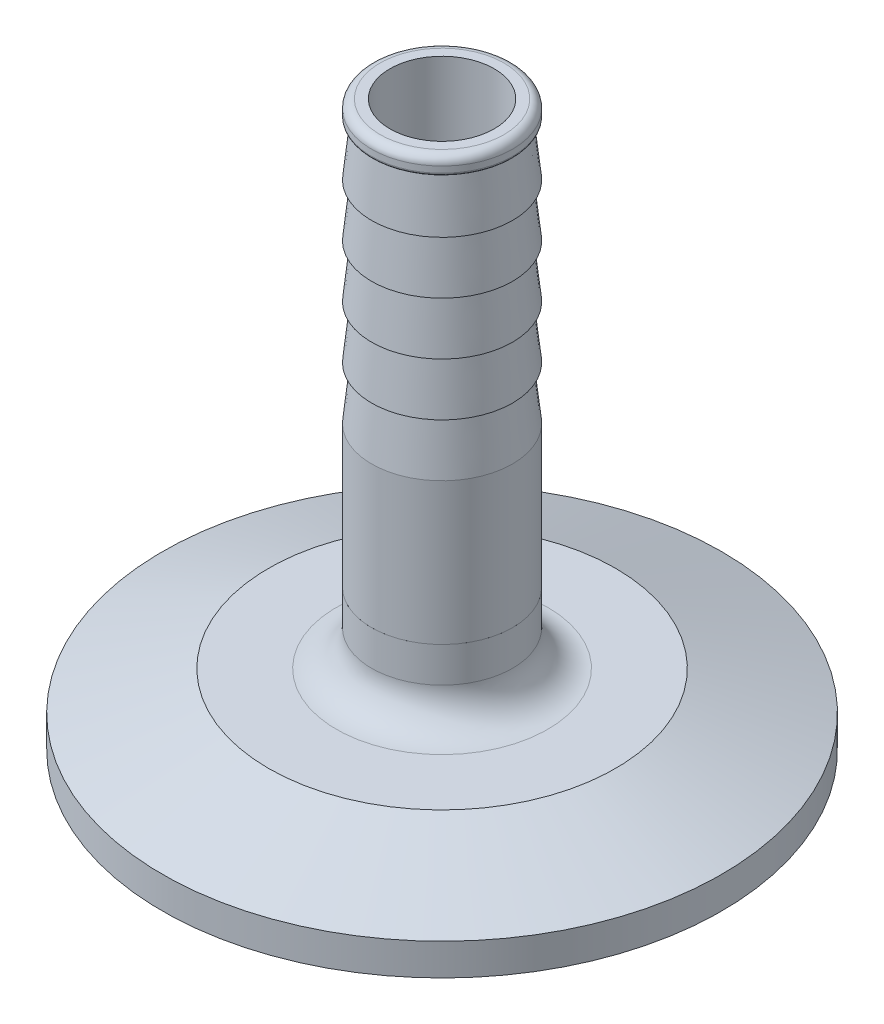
ISO-10303-21;
HEADER;
FILE_DESCRIPTION(('STEP AP214'),'2;1');
FILE_NAME('part.step','',(''),(''),'','','');
FILE_SCHEMA(('AUTOMOTIVE_DESIGN { 1 0 10303 214 1 1 1 1 }'));
ENDSEC;
DATA;
#1=APPLICATION_CONTEXT('core data for automotive mechanical design processes');
#2=APPLICATION_PROTOCOL_DEFINITION('international standard','automotive_design',2000,#1);
#3=PRODUCT_CONTEXT('',#1,'mechanical');
#4=PRODUCT('Part','Part','',(#3));
#5=PRODUCT_RELATED_PRODUCT_CATEGORY('part','',(#4));
#6=PRODUCT_DEFINITION_FORMATION('','',#4);
#7=PRODUCT_DEFINITION_CONTEXT('part definition',#1,'design');
#8=PRODUCT_DEFINITION('design','',#6,#7);
#9=PRODUCT_DEFINITION_SHAPE('','',#8);
#10=(LENGTH_UNIT() NAMED_UNIT(*) SI_UNIT(.MILLI.,.METRE.));
#11=(NAMED_UNIT(*) PLANE_ANGLE_UNIT() SI_UNIT($,.RADIAN.));
#12=(NAMED_UNIT(*) SI_UNIT($,.STERADIAN.) SOLID_ANGLE_UNIT());
#13=UNCERTAINTY_MEASURE_WITH_UNIT(LENGTH_MEASURE(1.E-05),#10,'distance_accuracy_value','');
#14=(GEOMETRIC_REPRESENTATION_CONTEXT(3) GLOBAL_UNCERTAINTY_ASSIGNED_CONTEXT((#13)) GLOBAL_UNIT_ASSIGNED_CONTEXT((#10,
#11,#12)) REPRESENTATION_CONTEXT('',''));
#15=CARTESIAN_POINT('',(0.,0.,0.));
#16=DIRECTION('',(0.,0.,1.));
#17=DIRECTION('',(1.,0.,0.));
#18=AXIS2_PLACEMENT_3D('',#15,#16,#17);
#19=CARTESIAN_POINT('',(13.1975958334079,31.5216000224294,44.2431456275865));
#20=DIRECTION('',(0.,-1.,0.));
#21=DIRECTION('',(0.,0.,-1.));
#22=AXIS2_PLACEMENT_3D('',#19,#20,#21);
#23=PLANE('',#22);
#24=CARTESIAN_POINT('',(17.8965958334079,31.5216000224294,44.2431456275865));
#25=DIRECTION('',(0.,-1.,0.));
#26=DIRECTION('',(0.,0.,-1.));
#27=AXIS2_PLACEMENT_3D('',#24,#25,#26);
#28=CIRCLE('',#27,6.35);
#29=CARTESIAN_POINT('',(17.8965958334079,31.5216000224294,37.8931456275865));
#30=VERTEX_POINT('',#29);
#31=EDGE_CURVE('P0_E10',#30,#30,#28,.T.);
#32=ORIENTED_EDGE('',*,*,#31,.F.);
#33=EDGE_LOOP('',(#32));
#34=FACE_BOUND('',#33,.T.);
#35=CARTESIAN_POINT('',(17.8965958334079,31.5216000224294,44.2431456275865));
#36=DIRECTION('',(0.,-1.,0.));
#37=DIRECTION('',(0.,0.,-1.));
#38=AXIS2_PLACEMENT_3D('',#35,#36,#37);
#39=CIRCLE('',#38,4.699);
#40=CARTESIAN_POINT('',(17.8965958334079,31.5216000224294,39.5441456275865));
#41=VERTEX_POINT('',#40);
#42=EDGE_CURVE('P0_E64',#41,#41,#39,.T.);
#43=ORIENTED_EDGE('',*,*,#42,.T.);
#44=EDGE_LOOP('',(#43));
#45=FACE_BOUND('',#44,.T.);
#46=ADVANCED_FACE('P0_F15',(#34,#45),#23,.F.);
#47=CARTESIAN_POINT('',(17.8965958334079,18.8216000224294,44.2431456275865));
#48=DIRECTION('',(0.,-1.,0.));
#49=DIRECTION('',(0.,0.,-1.));
#50=AXIS2_PLACEMENT_3D('',#47,#48,#49);
#51=CYLINDRICAL_SURFACE('',#50,6.35);
#52=CARTESIAN_POINT('',(17.8965958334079,28.3466000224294,44.2431456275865));
#53=DIRECTION('',(0.,-1.,0.));
#54=DIRECTION('',(0.,0.,-1.));
#55=AXIS2_PLACEMENT_3D('',#52,#53,#54);
#56=CIRCLE('',#55,6.35);
#57=CARTESIAN_POINT('',(17.8965958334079,28.3466000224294,37.8931456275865));
#58=VERTEX_POINT('',#57);
#59=EDGE_CURVE('P0_E21',#58,#58,#56,.T.);
#60=ORIENTED_EDGE('',*,*,#59,.F.);
#61=EDGE_LOOP('',(#60));
#62=FACE_BOUND('',#61,.T.);
#63=ORIENTED_EDGE('',*,*,#31,.T.);
#64=EDGE_LOOP('',(#63));
#65=FACE_BOUND('',#64,.T.);
#66=ADVANCED_FACE('P0_F143',(#62,#65),#51,.T.);
#67=CARTESIAN_POINT('',(17.8965958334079,28.3466000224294,44.2431456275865));
#68=DIRECTION('',(0.,-1.,0.));
#69=DIRECTION('',(0.,0.,-1.));
#70=AXIS2_PLACEMENT_3D('',#67,#68,#69);
#71=TOROIDAL_SURFACE('',#70,9.525,3.175);
#72=CARTESIAN_POINT('',(17.8965958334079,25.1716000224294,44.2431456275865));
#73=DIRECTION('',(0.,-1.,0.));
#74=DIRECTION('',(0.,0.,-1.));
#75=AXIS2_PLACEMENT_3D('',#72,#73,#74);
#76=CIRCLE('',#75,9.525);
#77=CARTESIAN_POINT('',(17.8965958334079,25.1716000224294,34.7181456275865));
#78=VERTEX_POINT('',#77);
#79=EDGE_CURVE('P0_E25',#78,#78,#76,.T.);
#80=ORIENTED_EDGE('',*,*,#79,.F.);
#81=EDGE_LOOP('',(#80));
#82=FACE_BOUND('',#81,.T.);
#83=ORIENTED_EDGE('',*,*,#59,.T.);
#84=EDGE_LOOP('',(#83));
#85=FACE_BOUND('',#84,.T.);
#86=ADVANCED_FACE('P0_F138',(#82,#85),#71,.F.);
#87=CARTESIAN_POINT('',(8.37159583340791,25.1716000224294,44.2431456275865));
#88=DIRECTION('',(0.,-1.,0.));
#89=DIRECTION('',(0.,0.,-1.));
#90=AXIS2_PLACEMENT_3D('',#87,#88,#89);
#91=PLANE('',#90);
#92=CARTESIAN_POINT('',(17.8965958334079,25.1716000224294,44.2431456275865));
#93=DIRECTION('',(0.,-1.,0.));
#94=DIRECTION('',(0.,0.,-1.));
#95=AXIS2_PLACEMENT_3D('',#92,#93,#94);
#96=CIRCLE('',#95,15.6301961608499);
#97=CARTESIAN_POINT('',(17.8965958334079,25.1716000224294,28.6129494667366));
#98=VERTEX_POINT('',#97);
#99=EDGE_CURVE('P0_E29',#98,#98,#96,.T.);
#100=ORIENTED_EDGE('',*,*,#99,.F.);
#101=EDGE_LOOP('',(#100));
#102=FACE_BOUND('',#101,.T.);
#103=ORIENTED_EDGE('',*,*,#79,.T.);
#104=EDGE_LOOP('',(#103));
#105=FACE_BOUND('',#104,.T.);
#106=ADVANCED_FACE('P0_F132',(#102,#105),#91,.F.);
#107=CARTESIAN_POINT('',(17.8965958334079,25.1716000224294,44.2431456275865));
#108=DIRECTION('',(0.,-1.,0.));
#109=DIRECTION('',(0.,0.,-1.));
#110=AXIS2_PLACEMENT_3D('',#107,#108,#109);
#111=CONICAL_SURFACE('',#110,15.6301961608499,1.22173047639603);
#112=CARTESIAN_POINT('',(17.8965958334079,21.689640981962,44.2431456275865));
#113=DIRECTION('',(0.,-1.,0.));
#114=DIRECTION('',(0.,0.,-1.));
#115=AXIS2_PLACEMENT_3D('',#112,#113,#114);
#116=CIRCLE('',#115,25.1968);
#117=CARTESIAN_POINT('',(17.8965958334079,21.689640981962,19.0463456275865));
#118=VERTEX_POINT('',#117);
#119=EDGE_CURVE('P0_E34',#118,#118,#116,.T.);
#120=ORIENTED_EDGE('',*,*,#119,.F.);
#121=EDGE_LOOP('',(#120));
#122=FACE_BOUND('',#121,.T.);
#123=ORIENTED_EDGE('',*,*,#99,.T.);
#124=EDGE_LOOP('',(#123));
#125=FACE_BOUND('',#124,.T.);
#126=ADVANCED_FACE('P0_F126',(#122,#125),#111,.T.);
#127=CARTESIAN_POINT('',(17.8965958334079,18.8216000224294,44.2431456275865));
#128=DIRECTION('',(0.,-1.,0.));
#129=DIRECTION('',(0.,0.,-1.));
#130=AXIS2_PLACEMENT_3D('',#127,#128,#129);
#131=CYLINDRICAL_SURFACE('',#130,25.1968);
#132=CARTESIAN_POINT('',(17.8965958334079,18.8216000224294,44.2431456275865));
#133=DIRECTION('',(0.,-1.,0.));
#134=DIRECTION('',(0.,0.,-1.));
#135=AXIS2_PLACEMENT_3D('',#132,#133,#134);
#136=CIRCLE('',#135,25.1968);
#137=CARTESIAN_POINT('',(17.8965958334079,18.8216000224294,19.0463456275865));
#138=VERTEX_POINT('',#137);
#139=EDGE_CURVE('P0_E37',#138,#138,#136,.T.);
#140=ORIENTED_EDGE('',*,*,#139,.F.);
#141=EDGE_LOOP('',(#140));
#142=FACE_BOUND('',#141,.T.);
#143=ORIENTED_EDGE('',*,*,#119,.T.);
#144=EDGE_LOOP('',(#143));
#145=FACE_BOUND('',#144,.T.);
#146=ADVANCED_FACE('P0_F120',(#142,#145),#131,.T.);
#147=CARTESIAN_POINT('',(-7.30020416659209,18.8216000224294,44.2431456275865));
#148=DIRECTION('',(0.,1.,0.));
#149=DIRECTION('',(0.,0.,1.));
#150=AXIS2_PLACEMENT_3D('',#147,#148,#149);
#151=PLANE('',#150);
#152=CARTESIAN_POINT('',(17.8965958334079,18.8216000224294,44.2431456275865));
#153=DIRECTION('',(0.,-1.,0.));
#154=DIRECTION('',(0.,0.,-1.));
#155=AXIS2_PLACEMENT_3D('',#152,#153,#154);
#156=CIRCLE('',#155,23.8091722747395);
#157=CARTESIAN_POINT('',(17.8965958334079,18.8216000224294,20.433973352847));
#158=VERTEX_POINT('',#157);
#159=EDGE_CURVE('P0_E40',#158,#158,#156,.T.);
#160=ORIENTED_EDGE('',*,*,#159,.F.);
#161=EDGE_LOOP('',(#160));
#162=FACE_BOUND('',#161,.T.);
#163=ORIENTED_EDGE('',*,*,#139,.T.);
#164=EDGE_LOOP('',(#163));
#165=FACE_BOUND('',#164,.T.);
#166=ADVANCED_FACE('P0_F114',(#162,#165),#151,.F.);
#167=CARTESIAN_POINT('',(17.8965958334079,19.6090000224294,44.2431456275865));
#168=DIRECTION('',(0.,-1.,0.));
#169=DIRECTION('',(0.,0.,-1.));
#170=AXIS2_PLACEMENT_3D('',#167,#168,#169);
#171=TOROIDAL_SURFACE('',#170,23.8091722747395,0.787399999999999);
#172=CARTESIAN_POINT('',(17.8965958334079,19.301338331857,44.2431456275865));
#173=DIRECTION('',(0.,-1.,0.));
#174=DIRECTION('',(0.,0.,-1.));
#175=AXIS2_PLACEMENT_3D('',#172,#173,#174);
#176=CIRCLE('',#175,23.0843667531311);
#177=CARTESIAN_POINT('',(17.8965958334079,19.301338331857,21.1587788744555));
#178=VERTEX_POINT('',#177);
#179=EDGE_CURVE('P0_E43',#178,#178,#176,.T.);
#180=ORIENTED_EDGE('',*,*,#179,.F.);
#181=EDGE_LOOP('',(#180));
#182=FACE_BOUND('',#181,.T.);
#183=ORIENTED_EDGE('',*,*,#159,.T.);
#184=EDGE_LOOP('',(#183));
#185=FACE_BOUND('',#184,.T.);
#186=ADVANCED_FACE('P0_F108',(#182,#185),#171,.T.);
#187=CARTESIAN_POINT('',(17.8965958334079,19.301338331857,44.2431456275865));
#188=DIRECTION('',(0.,-1.,0.));
#189=DIRECTION('',(0.,0.,-1.));
#190=AXIS2_PLACEMENT_3D('',#187,#188,#189);
#191=CONICAL_SURFACE('',#190,23.0843667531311,0.401425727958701);
#192=CARTESIAN_POINT('',(17.8965958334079,19.6944548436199,44.2431456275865));
#193=DIRECTION('',(0.,-1.,0.));
#194=DIRECTION('',(0.,0.,-1.));
#195=AXIS2_PLACEMENT_3D('',#192,#193,#194);
#196=CIRCLE('',#195,22.9174986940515);
#197=CARTESIAN_POINT('',(17.8965958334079,19.6944548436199,21.325646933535));
#198=VERTEX_POINT('',#197);
#199=EDGE_CURVE('P0_E46',#198,#198,#196,.T.);
#200=ORIENTED_EDGE('',*,*,#199,.F.);
#201=EDGE_LOOP('',(#200));
#202=FACE_BOUND('',#201,.T.);
#203=ORIENTED_EDGE('',*,*,#179,.T.);
#204=EDGE_LOOP('',(#203));
#205=FACE_BOUND('',#204,.T.);
#206=ADVANCED_FACE('P0_F102',(#202,#205),#191,.F.);
#207=CARTESIAN_POINT('',(17.8965958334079,19.2280000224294,44.2431456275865));
#208=DIRECTION('',(0.,-1.,0.));
#209=DIRECTION('',(0.,0.,-1.));
#210=AXIS2_PLACEMENT_3D('',#207,#208,#209);
#211=TOROIDAL_SURFACE('',#210,21.8186,1.1938);
#212=CARTESIAN_POINT('',(17.8965958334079,19.6944548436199,44.2431456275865));
#213=DIRECTION('',(0.,-1.,0.));
#214=DIRECTION('',(0.,0.,-1.));
#215=AXIS2_PLACEMENT_3D('',#212,#213,#214);
#216=CIRCLE('',#215,20.7197013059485);
#217=CARTESIAN_POINT('',(17.8965958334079,19.6944548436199,23.523444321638));
#218=VERTEX_POINT('',#217);
#219=EDGE_CURVE('P0_E49',#218,#218,#216,.T.);
#220=ORIENTED_EDGE('',*,*,#219,.F.);
#221=EDGE_LOOP('',(#220));
#222=FACE_BOUND('',#221,.T.);
#223=ORIENTED_EDGE('',*,*,#199,.T.);
#224=EDGE_LOOP('',(#223));
#225=FACE_BOUND('',#224,.T.);
#226=ADVANCED_FACE('P0_F96',(#222,#225),#211,.F.);
#227=CARTESIAN_POINT('',(17.8965958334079,19.6944548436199,44.2431456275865));
#228=DIRECTION('',(0.,1.,0.));
#229=DIRECTION('',(0.,0.,1.));
#230=AXIS2_PLACEMENT_3D('',#227,#228,#229);
#231=CONICAL_SURFACE('',#230,20.7197013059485,0.401425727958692);
#232=CARTESIAN_POINT('',(17.8965958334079,19.301338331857,44.2431456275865));
#233=DIRECTION('',(0.,-1.,0.));
#234=DIRECTION('',(0.,0.,-1.));
#235=AXIS2_PLACEMENT_3D('',#232,#233,#234);
#236=CIRCLE('',#235,20.5528332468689);
#237=CARTESIAN_POINT('',(17.8965958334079,19.301338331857,23.6903123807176));
#238=VERTEX_POINT('',#237);
#239=EDGE_CURVE('P0_E52',#238,#238,#236,.T.);
#240=ORIENTED_EDGE('',*,*,#239,.F.);
#241=EDGE_LOOP('',(#240));
#242=FACE_BOUND('',#241,.T.);
#243=ORIENTED_EDGE('',*,*,#219,.T.);
#244=EDGE_LOOP('',(#243));
#245=FACE_BOUND('',#244,.T.);
#246=ADVANCED_FACE('P0_F90',(#242,#245),#231,.T.);
#247=CARTESIAN_POINT('',(17.8965958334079,19.6090000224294,44.2431456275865));
#248=DIRECTION('',(0.,-1.,0.));
#249=DIRECTION('',(0.,0.,-1.));
#250=AXIS2_PLACEMENT_3D('',#247,#248,#249);
#251=TOROIDAL_SURFACE('',#250,19.8280277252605,0.787399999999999);
#252=CARTESIAN_POINT('',(17.8965958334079,18.8216000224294,44.2431456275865));
#253=DIRECTION('',(0.,-1.,0.));
#254=DIRECTION('',(0.,0.,-1.));
#255=AXIS2_PLACEMENT_3D('',#252,#253,#254);
#256=CIRCLE('',#255,19.8280277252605);
#257=CARTESIAN_POINT('',(17.8965958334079,18.8216000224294,24.415117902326));
#258=VERTEX_POINT('',#257);
#259=EDGE_CURVE('P0_E55',#258,#258,#256,.T.);
#260=ORIENTED_EDGE('',*,*,#259,.F.);
#261=EDGE_LOOP('',(#260));
#262=FACE_BOUND('',#261,.T.);
#263=ORIENTED_EDGE('',*,*,#239,.T.);
#264=EDGE_LOOP('',(#263));
#265=FACE_BOUND('',#264,.T.);
#266=ADVANCED_FACE('P0_F84',(#262,#265),#251,.T.);
#267=CARTESIAN_POINT('',(-1.93143189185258,18.8216000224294,44.2431456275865));
#268=DIRECTION('',(0.,1.,0.));
#269=DIRECTION('',(0.,0.,1.));
#270=AXIS2_PLACEMENT_3D('',#267,#268,#269);
#271=PLANE('',#270);
#272=CARTESIAN_POINT('',(17.8965958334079,18.8216000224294,44.2431456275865));
#273=DIRECTION('',(0.,-1.,0.));
#274=DIRECTION('',(0.,0.,-1.));
#275=AXIS2_PLACEMENT_3D('',#272,#273,#274);
#276=CIRCLE('',#275,11.049);
#277=CARTESIAN_POINT('',(17.8965958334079,18.8216000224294,33.1941456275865));
#278=VERTEX_POINT('',#277);
#279=EDGE_CURVE('P0_E58',#278,#278,#276,.T.);
#280=ORIENTED_EDGE('',*,*,#279,.F.);
#281=EDGE_LOOP('',(#280));
#282=FACE_BOUND('',#281,.T.);
#283=ORIENTED_EDGE('',*,*,#259,.T.);
#284=EDGE_LOOP('',(#283));
#285=FACE_BOUND('',#284,.T.);
#286=ADVANCED_FACE('P0_F78',(#282,#285),#271,.F.);
#287=CARTESIAN_POINT('',(17.8965958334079,18.8216000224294,44.2431456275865));
#288=DIRECTION('',(0.,-1.,0.));
#289=DIRECTION('',(0.,0.,-1.));
#290=AXIS2_PLACEMENT_3D('',#287,#288,#289);
#291=CONICAL_SURFACE('',#290,11.049,0.65606926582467);
#292=CARTESIAN_POINT('',(17.8965958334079,27.0702207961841,44.2431456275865));
#293=DIRECTION('',(0.,-1.,0.));
#294=DIRECTION('',(0.,0.,-1.));
#295=AXIS2_PLACEMENT_3D('',#292,#293,#294);
#296=CIRCLE('',#295,4.699);
#297=CARTESIAN_POINT('',(17.8965958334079,27.0702207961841,39.5441456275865));
#298=VERTEX_POINT('',#297);
#299=EDGE_CURVE('P0_E61',#298,#298,#296,.T.);
#300=ORIENTED_EDGE('',*,*,#299,.F.);
#301=EDGE_LOOP('',(#300));
#302=FACE_BOUND('',#301,.T.);
#303=ORIENTED_EDGE('',*,*,#279,.T.);
#304=EDGE_LOOP('',(#303));
#305=FACE_BOUND('',#304,.T.);
#306=ADVANCED_FACE('P0_F72',(#302,#305),#291,.F.);
#307=CARTESIAN_POINT('',(17.8965958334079,18.8216000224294,44.2431456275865));
#308=DIRECTION('',(0.,-1.,0.));
#309=DIRECTION('',(0.,0.,-1.));
#310=AXIS2_PLACEMENT_3D('',#307,#308,#309);
#311=CYLINDRICAL_SURFACE('',#310,4.699);
#312=ORIENTED_EDGE('',*,*,#42,.F.);
#313=EDGE_LOOP('',(#312));
#314=FACE_BOUND('',#313,.T.);
#315=ORIENTED_EDGE('',*,*,#299,.T.);
#316=EDGE_LOOP('',(#315));
#317=FACE_BOUND('',#316,.T.);
#318=ADVANCED_FACE('P0_F69',(#314,#317),#311,.F.);
#319=CLOSED_SHELL('',(#46,#66,#86,#106,#126,#146,#166,#186,#206,#226,#246,#266,#286,#306,#318));
#320=MANIFOLD_SOLID_BREP('P0_B1',#319);
#321=CARTESIAN_POINT('',(20.8775100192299,31.5216000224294,49.8499850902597));
#322=DIRECTION('',(0.,-0.999999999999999,0.));
#323=DIRECTION('',(0.882966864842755,0.,-0.469435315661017));
#324=AXIS2_PLACEMENT_3D('',#321,#322,#323);
#325=PLANE('',#324);
#326=CARTESIAN_POINT('',(17.8965958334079,31.5216000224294,44.2431456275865));
#327=DIRECTION('',(0.,-0.999999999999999,0.));
#328=DIRECTION('',(0.882966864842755,0.,-0.469435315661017));
#329=AXIS2_PLACEMENT_3D('',#326,#327,#328);
#330=CIRCLE('',#329,4.699);
#331=CARTESIAN_POINT('',(22.045657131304,31.5216000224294,42.0372690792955));
#332=VERTEX_POINT('',#331);
#333=EDGE_CURVE('P1_E67',#332,#332,#330,.T.);
#334=ORIENTED_EDGE('',*,*,#333,.F.);
#335=EDGE_LOOP('',(#334));
#336=FACE_BOUND('',#335,.T.);
#337=CARTESIAN_POINT('',(17.8965958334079,31.5216000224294,44.2431456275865));
#338=DIRECTION('',(0.,-0.999999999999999,0.));
#339=DIRECTION('',(0.882966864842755,0.,-0.469435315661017));
#340=AXIS2_PLACEMENT_3D('',#337,#338,#339);
#341=CIRCLE('',#340,6.34999985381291);
#342=CARTESIAN_POINT('',(23.503435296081,31.5216000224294,41.2622314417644));
#343=VERTEX_POINT('',#342);
#344=EDGE_CURVE('P1_E9',#343,#343,#341,.T.);
#345=ORIENTED_EDGE('',*,*,#344,.T.);
#346=EDGE_LOOP('',(#345));
#347=FACE_BOUND('',#346,.T.);
#348=ADVANCED_FACE('P1_F14',(#336,#347),#325,.T.);
#349=CARTESIAN_POINT('',(17.8965958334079,31.5216000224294,44.2431456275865));
#350=DIRECTION('',(0.,-0.999999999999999,0.));
#351=DIRECTION('',(0.882966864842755,0.,-0.469435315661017));
#352=AXIS2_PLACEMENT_3D('',#349,#350,#351);
#353=CYLINDRICAL_SURFACE('',#352,6.34999985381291);
#354=CARTESIAN_POINT('',(17.8965958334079,44.2978000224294,44.2431456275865));
#355=DIRECTION('',(0.,-0.999999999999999,0.));
#356=DIRECTION('',(0.882966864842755,0.,-0.469435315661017));
#357=AXIS2_PLACEMENT_3D('',#354,#355,#356);
#358=CIRCLE('',#357,6.34999985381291);
#359=CARTESIAN_POINT('',(23.503435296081,44.2978000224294,41.2622314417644));
#360=VERTEX_POINT('',#359);
#361=EDGE_CURVE('P1_E20',#360,#360,#358,.T.);
#362=CARTESIAN_POINT('',(23.503435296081,44.2978000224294,41.2622314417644));
#363=CARTESIAN_POINT('',(23.503435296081,44.1647146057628,41.2622314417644));
#364=CARTESIAN_POINT('',(23.503435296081,44.0316291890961,41.2622314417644));
#365=CARTESIAN_POINT('',(23.503435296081,43.7654583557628,41.2622314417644));
#366=CARTESIAN_POINT('',(23.503435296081,43.6323729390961,41.2622314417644));
#367=CARTESIAN_POINT('',(23.503435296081,43.3662021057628,41.2622314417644));
#368=CARTESIAN_POINT('',(23.503435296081,43.2331166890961,41.2622314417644));
#369=CARTESIAN_POINT('',(23.503435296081,42.9669458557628,41.2622314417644));
#370=CARTESIAN_POINT('',(23.503435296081,42.8338604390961,41.2622314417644));
#371=CARTESIAN_POINT('',(23.503435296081,42.5676896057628,41.2622314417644));
#372=CARTESIAN_POINT('',(23.503435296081,42.4346041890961,41.2622314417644));
#373=CARTESIAN_POINT('',(23.503435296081,42.1684333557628,41.2622314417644));
#374=CARTESIAN_POINT('',(23.503435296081,42.0353479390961,41.2622314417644));
#375=CARTESIAN_POINT('',(23.503435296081,41.7691771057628,41.2622314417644));
#376=CARTESIAN_POINT('',(23.503435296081,41.6360916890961,41.2622314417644));
#377=CARTESIAN_POINT('',(23.503435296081,41.3699208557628,41.2622314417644));
#378=CARTESIAN_POINT('',(23.503435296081,41.2368354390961,41.2622314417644));
#379=CARTESIAN_POINT('',(23.503435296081,40.9706646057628,41.2622314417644));
#380=CARTESIAN_POINT('',(23.503435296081,40.8375791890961,41.2622314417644));
#381=CARTESIAN_POINT('',(23.503435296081,40.5714083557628,41.2622314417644));
#382=CARTESIAN_POINT('',(23.503435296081,40.4383229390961,41.2622314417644));
#383=CARTESIAN_POINT('',(23.503435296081,40.1721521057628,41.2622314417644));
#384=CARTESIAN_POINT('',(23.503435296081,40.0390666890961,41.2622314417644));
#385=CARTESIAN_POINT('',(23.503435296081,39.7728958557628,41.2622314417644));
#386=CARTESIAN_POINT('',(23.503435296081,39.6398104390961,41.2622314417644));
#387=CARTESIAN_POINT('',(23.503435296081,39.3736396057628,41.2622314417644));
#388=CARTESIAN_POINT('',(23.503435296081,39.2405541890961,41.2622314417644));
#389=CARTESIAN_POINT('',(23.503435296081,38.9743833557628,41.2622314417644));
#390=CARTESIAN_POINT('',(23.503435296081,38.8412979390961,41.2622314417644));
#391=CARTESIAN_POINT('',(23.503435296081,38.5751271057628,41.2622314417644));
#392=CARTESIAN_POINT('',(23.503435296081,38.4420416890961,41.2622314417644));
#393=CARTESIAN_POINT('',(23.503435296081,38.1758708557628,41.2622314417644));
#394=CARTESIAN_POINT('',(23.503435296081,38.0427854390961,41.2622314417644));
#395=CARTESIAN_POINT('',(23.503435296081,37.7766146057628,41.2622314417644));
#396=CARTESIAN_POINT('',(23.503435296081,37.6435291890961,41.2622314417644));
#397=CARTESIAN_POINT('',(23.503435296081,37.3773583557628,41.2622314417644));
#398=CARTESIAN_POINT('',(23.503435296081,37.2442729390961,41.2622314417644));
#399=CARTESIAN_POINT('',(23.503435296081,36.9781021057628,41.2622314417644));
#400=CARTESIAN_POINT('',(23.503435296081,36.8450166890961,41.2622314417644));
#401=CARTESIAN_POINT('',(23.503435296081,36.5788458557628,41.2622314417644));
#402=CARTESIAN_POINT('',(23.503435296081,36.4457604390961,41.2622314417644));
#403=CARTESIAN_POINT('',(23.503435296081,36.1795896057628,41.2622314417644));
#404=CARTESIAN_POINT('',(23.503435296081,36.0465041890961,41.2622314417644));
#405=CARTESIAN_POINT('',(23.503435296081,35.7803333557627,41.2622314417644));
#406=CARTESIAN_POINT('',(23.503435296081,35.6472479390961,41.2622314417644));
#407=CARTESIAN_POINT('',(23.503435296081,35.3810771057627,41.2622314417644));
#408=CARTESIAN_POINT('',(23.503435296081,35.2479916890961,41.2622314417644));
#409=CARTESIAN_POINT('',(23.503435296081,34.9818208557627,41.2622314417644));
#410=CARTESIAN_POINT('',(23.503435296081,34.8487354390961,41.2622314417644));
#411=CARTESIAN_POINT('',(23.503435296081,34.5825646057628,41.2622314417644));
#412=CARTESIAN_POINT('',(23.503435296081,34.4494791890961,41.2622314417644));
#413=CARTESIAN_POINT('',(23.503435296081,34.1833083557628,41.2622314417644));
#414=CARTESIAN_POINT('',(23.503435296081,34.0502229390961,41.2622314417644));
#415=CARTESIAN_POINT('',(23.503435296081,33.7840521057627,41.2622314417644));
#416=CARTESIAN_POINT('',(23.503435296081,33.6509666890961,41.2622314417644));
#417=CARTESIAN_POINT('',(23.503435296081,33.3847958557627,41.2622314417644));
#418=CARTESIAN_POINT('',(23.503435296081,33.2517104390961,41.2622314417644));
#419=CARTESIAN_POINT('',(23.503435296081,32.9855396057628,41.2622314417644));
#420=CARTESIAN_POINT('',(23.503435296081,32.8524541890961,41.2622314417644));
#421=CARTESIAN_POINT('',(23.503435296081,32.5862833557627,41.2622314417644));
#422=CARTESIAN_POINT('',(23.503435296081,32.4531979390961,41.2622314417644));
#423=CARTESIAN_POINT('',(23.503435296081,32.1870271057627,41.2622314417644));
#424=CARTESIAN_POINT('',(23.503435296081,32.0539416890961,41.2622314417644));
#425=CARTESIAN_POINT('',(23.503435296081,31.7877708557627,41.2622314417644));
#426=CARTESIAN_POINT('',(23.503435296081,31.6546854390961,41.2622314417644));
#427=CARTESIAN_POINT('',(23.503435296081,31.5216000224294,41.2622314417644));
#428=B_SPLINE_CURVE_WITH_KNOTS('',3,(#362,#363,#364,#365,#366,#367,#368,#369,#370,#371,#372,
#373,#374,#375,#376,#377,#378,#379,#380,#381,#382,#383,#384,#385,#386,#387,#388,#389,#390,#391,
#392,#393,#394,#395,#396,#397,#398,#399,#400,#401,#402,#403,#404,#405,#406,#407,#408,#409,#410,
#411,#412,#413,#414,#415,#416,#417,#418,#419,#420,#421,#422,#423,#424,#425,#426,#427),
.UNSPECIFIED.,.F.,.F.,(4,2,2,2,2,2,2,2,2,2,2,2,2,2,2,2,2,2,2,2,2,2,2,2,2,2,2,2,2,2,2,2,4),(0.,
0.399256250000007,0.798512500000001,1.19776875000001,1.597025,1.99628125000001,2.39553750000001,
2.79479375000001,3.19405,3.59330625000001,3.9925625,4.39181875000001,4.79107500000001,
5.19033125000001,5.58958750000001,5.98884375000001,6.38810000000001,6.78735625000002,
7.18661250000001,7.58586875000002,7.98512500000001,8.38438125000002,8.78363750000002,
9.18289375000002,9.58215000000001,9.98140625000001,10.3806625,10.77991875,11.179175,11.57843125,
11.9776875,12.37694375,12.7762),.UNSPECIFIED.);
#429=EDGE_CURVE('P1_BSEAM83',#360,#343,#428,.T.);
#430=ORIENTED_EDGE('',*,*,#361,.T.);
#431=ORIENTED_EDGE('',*,*,#344,.F.);
#432=ORIENTED_EDGE('',*,*,#429,.T.);
#433=ORIENTED_EDGE('',*,*,#429,.F.);
#434=EDGE_LOOP('',(#430,#432,#431,#433));
#435=FACE_BOUND('',#434,.T.);
#436=ADVANCED_FACE('P1_F83',(#435),#353,.T.);
#437=CARTESIAN_POINT('',(17.8965958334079,44.2978000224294,44.2431456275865));
#438=DIRECTION('',(0.,-0.999999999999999,0.));
#439=DIRECTION('',(0.882966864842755,0.,-0.469435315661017));
#440=AXIS2_PLACEMENT_3D('',#437,#438,#439);
#441=CONICAL_SURFACE('',#440,6.34999985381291,0.106546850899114);
#442=CARTESIAN_POINT('',(17.896595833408,49.0476000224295,44.2431456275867));
#443=DIRECTION('',(0.,-0.999999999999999,0.));
#444=DIRECTION('',(0.882966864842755,0.,-0.469435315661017));
#445=AXIS2_PLACEMENT_3D('',#442,#443,#444);
#446=CIRCLE('',#445,5.84199985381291);
#447=CARTESIAN_POINT('',(23.0548881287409,49.0476000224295,41.5007045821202));
#448=VERTEX_POINT('',#447);
#449=EDGE_CURVE('P1_E24',#448,#448,#446,.T.);
#450=CARTESIAN_POINT('',(23.0548881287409,49.0476000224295,41.5007045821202));
#451=CARTESIAN_POINT('',(23.0595604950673,48.9981229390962,41.4982204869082));
#452=CARTESIAN_POINT('',(23.0642328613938,48.9486458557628,41.4957363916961));
#453=CARTESIAN_POINT('',(23.0735775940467,48.8496916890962,41.4907682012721));
#454=CARTESIAN_POINT('',(23.0782499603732,48.8002146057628,41.48828410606));
#455=CARTESIAN_POINT('',(23.0875946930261,48.7012604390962,41.4833159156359));
#456=CARTESIAN_POINT('',(23.0922670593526,48.6517833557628,41.4808318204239));
#457=CARTESIAN_POINT('',(23.1016117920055,48.5528291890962,41.4758636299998));
#458=CARTESIAN_POINT('',(23.1062841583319,48.5033521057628,41.4733795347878));
#459=CARTESIAN_POINT('',(23.1156288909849,48.4043979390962,41.4684113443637));
#460=CARTESIAN_POINT('',(23.1203012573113,48.3549208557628,41.4659272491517));
#461=CARTESIAN_POINT('',(23.1296459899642,48.2559666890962,41.4609590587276));
#462=CARTESIAN_POINT('',(23.1343183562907,48.2064896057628,41.4584749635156));
#463=CARTESIAN_POINT('',(23.1436630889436,48.1075354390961,41.4535067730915));
#464=CARTESIAN_POINT('',(23.1483354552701,48.0580583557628,41.4510226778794));
#465=CARTESIAN_POINT('',(23.157680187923,47.9591041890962,41.4460544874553));
#466=CARTESIAN_POINT('',(23.1623525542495,47.9096271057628,41.4435703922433));
#467=CARTESIAN_POINT('',(23.1716972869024,47.8106729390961,41.4386022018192));
#468=CARTESIAN_POINT('',(23.1763696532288,47.7611958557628,41.4361181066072));
#469=CARTESIAN_POINT('',(23.1857143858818,47.6622416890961,41.4311499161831));
#470=CARTESIAN_POINT('',(23.1903867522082,47.6127646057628,41.4286658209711));
#471=CARTESIAN_POINT('',(23.1997314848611,47.5138104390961,41.423697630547));
#472=CARTESIAN_POINT('',(23.2044038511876,47.4643333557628,41.421213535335));
#473=CARTESIAN_POINT('',(23.2137485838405,47.3653791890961,41.4162453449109));
#474=CARTESIAN_POINT('',(23.218420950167,47.3159021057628,41.4137612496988));
#475=CARTESIAN_POINT('',(23.2277656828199,47.2169479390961,41.4087930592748));
#476=CARTESIAN_POINT('',(23.2324380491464,47.1674708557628,41.4063089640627));
#477=CARTESIAN_POINT('',(23.2417827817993,47.0685166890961,41.4013407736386));
#478=CARTESIAN_POINT('',(23.2464551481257,47.0190396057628,41.3988566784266));
#479=CARTESIAN_POINT('',(23.2557998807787,46.9200854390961,41.3938884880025));
#480=CARTESIAN_POINT('',(23.2604722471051,46.8706083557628,41.3914043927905));
#481=CARTESIAN_POINT('',(23.269816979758,46.7716541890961,41.3864362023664));
#482=CARTESIAN_POINT('',(23.2744893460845,46.7221771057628,41.3839521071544));
#483=CARTESIAN_POINT('',(23.2838340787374,46.6232229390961,41.3789839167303));
#484=CARTESIAN_POINT('',(23.2885064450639,46.5737458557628,41.3764998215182));
#485=CARTESIAN_POINT('',(23.2978511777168,46.4747916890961,41.3715316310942));
#486=CARTESIAN_POINT('',(23.3025235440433,46.4253146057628,41.3690475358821));
#487=CARTESIAN_POINT('',(23.3118682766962,46.3263604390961,41.364079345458));
#488=CARTESIAN_POINT('',(23.3165406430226,46.2768833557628,41.361595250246));
#489=CARTESIAN_POINT('',(23.3258853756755,46.1779291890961,41.3566270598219));
#490=CARTESIAN_POINT('',(23.330557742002,46.1284521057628,41.3541429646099));
#491=CARTESIAN_POINT('',(23.3399024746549,46.0294979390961,41.3491747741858));
#492=CARTESIAN_POINT('',(23.3445748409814,45.9800208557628,41.3466906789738));
#493=CARTESIAN_POINT('',(23.3539195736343,45.8810666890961,41.3417224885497));
#494=CARTESIAN_POINT('',(23.3585919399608,45.8315896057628,41.3392383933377));
#495=CARTESIAN_POINT('',(23.3679366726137,45.7326354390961,41.3342702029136));
#496=CARTESIAN_POINT('',(23.3726090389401,45.6831583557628,41.3317861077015));
#497=CARTESIAN_POINT('',(23.3819537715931,45.5842041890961,41.3268179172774));
#498=CARTESIAN_POINT('',(23.3866261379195,45.5347271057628,41.3243338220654));
#499=CARTESIAN_POINT('',(23.3959708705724,45.4357729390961,41.3193656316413));
#500=CARTESIAN_POINT('',(23.4006432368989,45.3862958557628,41.3168815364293));
#501=CARTESIAN_POINT('',(23.4099879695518,45.2873416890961,41.3119133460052));
#502=CARTESIAN_POINT('',(23.4146603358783,45.2378646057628,41.3094292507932));
#503=CARTESIAN_POINT('',(23.4240050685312,45.1389104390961,41.3044610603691));
#504=CARTESIAN_POINT('',(23.4286774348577,45.0894333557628,41.3019769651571));
#505=CARTESIAN_POINT('',(23.4380221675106,44.9904791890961,41.297008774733));
#506=CARTESIAN_POINT('',(23.442694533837,44.9410021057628,41.2945246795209));
#507=CARTESIAN_POINT('',(23.45203926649,44.8420479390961,41.2895564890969));
#508=CARTESIAN_POINT('',(23.4567116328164,44.7925708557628,41.2870723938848));
#509=CARTESIAN_POINT('',(23.4660563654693,44.6936166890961,41.2821042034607));
#510=CARTESIAN_POINT('',(23.4707287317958,44.6441396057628,41.2796201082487));
#511=CARTESIAN_POINT('',(23.4800734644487,44.5451854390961,41.2746519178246));
#512=CARTESIAN_POINT('',(23.4847458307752,44.4957083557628,41.2721678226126));
#513=CARTESIAN_POINT('',(23.4940905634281,44.3967541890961,41.2671996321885));
#514=CARTESIAN_POINT('',(23.4987629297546,44.3472771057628,41.2647155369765));
#515=CARTESIAN_POINT('',(23.503435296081,44.2978000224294,41.2622314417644));
#516=B_SPLINE_CURVE_WITH_KNOTS('',3,(#450,#451,#452,#453,#454,#455,#456,#457,#458,#459,#460,
#461,#462,#463,#464,#465,#466,#467,#468,#469,#470,#471,#472,#473,#474,#475,#476,#477,#478,#479,
#480,#481,#482,#483,#484,#485,#486,#487,#488,#489,#490,#491,#492,#493,#494,#495,#496,#497,#498,
#499,#500,#501,#502,#503,#504,#505,#506,#507,#508,#509,#510,#511,#512,#513,#514,#515),
.UNSPECIFIED.,.F.,.F.,(4,2,2,2,2,2,2,2,2,2,2,2,2,2,2,2,2,2,2,2,2,2,2,2,2,2,2,2,2,2,2,2,4),(0.,
0.149277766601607,0.298555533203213,0.44783329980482,0.59711106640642,0.746388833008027,
0.895666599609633,1.04494436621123,1.19422213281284,1.34349989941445,1.49277766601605,
1.64205543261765,1.79133319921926,1.94061096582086,2.08988873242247,2.23916649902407,
2.38844426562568,2.53772203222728,2.68699979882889,2.83627756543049,2.98555533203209,
3.1348330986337,3.28411086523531,3.43338863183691,3.58266639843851,3.73194416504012,
3.88122193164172,4.03049969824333,4.17977746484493,4.32905523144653,4.47833299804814,
4.62761076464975,4.77688853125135),.UNSPECIFIED.);
#517=EDGE_CURVE('P1_BSEAM88',#448,#360,#516,.T.);
#518=ORIENTED_EDGE('',*,*,#449,.T.);
#519=ORIENTED_EDGE('',*,*,#361,.F.);
#520=ORIENTED_EDGE('',*,*,#517,.T.);
#521=ORIENTED_EDGE('',*,*,#517,.F.);
#522=EDGE_LOOP('',(#518,#520,#519,#521));
#523=FACE_BOUND('',#522,.T.);
#524=ADVANCED_FACE('P1_F88',(#523),#441,.T.);
#525=CARTESIAN_POINT('',(20.8775100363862,49.0476000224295,49.8499851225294));
#526=DIRECTION('',(0.,-0.999999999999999,0.));
#527=DIRECTION('',(0.882966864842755,0.,-0.469435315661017));
#528=AXIS2_PLACEMENT_3D('',#525,#526,#527);
#529=PLANE('',#528);
#530=CARTESIAN_POINT('',(17.896595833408,49.0476000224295,44.2431456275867));
#531=DIRECTION('',(0.,-0.999999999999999,0.));
#532=DIRECTION('',(0.882966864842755,0.,-0.469435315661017));
#533=AXIS2_PLACEMENT_3D('',#530,#531,#532);
#534=CIRCLE('',#533,6.34999989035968);
#535=CARTESIAN_POINT('',(23.5034353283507,49.0476000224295,41.2622314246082));
#536=VERTEX_POINT('',#535);
#537=EDGE_CURVE('P1_E28',#536,#536,#534,.T.);
#538=ORIENTED_EDGE('',*,*,#537,.T.);
#539=EDGE_LOOP('',(#538));
#540=FACE_BOUND('',#539,.T.);
#541=ORIENTED_EDGE('',*,*,#449,.F.);
#542=EDGE_LOOP('',(#541));
#543=FACE_BOUND('',#542,.T.);
#544=ADVANCED_FACE('P1_F92',(#540,#543),#529,.T.);
#545=CARTESIAN_POINT('',(17.896595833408,49.0476000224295,44.2431456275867));
#546=DIRECTION('',(0.,-0.999999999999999,0.));
#547=DIRECTION('',(0.882966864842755,0.,-0.469435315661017));
#548=AXIS2_PLACEMENT_3D('',#545,#546,#547);
#549=CONICAL_SURFACE('',#548,6.34999989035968,0.106546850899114);
#550=CARTESIAN_POINT('',(17.896595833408,53.7974000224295,44.2431456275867));
#551=DIRECTION('',(0.,-0.999999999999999,0.));
#552=DIRECTION('',(0.882966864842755,0.,-0.469435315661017));
#553=AXIS2_PLACEMENT_3D('',#550,#551,#552);
#554=CIRCLE('',#553,5.84199989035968);
#555=CARTESIAN_POINT('',(23.0548881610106,53.7974000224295,41.500704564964));
#556=VERTEX_POINT('',#555);
#557=EDGE_CURVE('P1_E33',#556,#556,#554,.T.);
#558=CARTESIAN_POINT('',(23.0548881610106,53.7974000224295,41.500704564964));
#559=CARTESIAN_POINT('',(23.059560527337,53.7479229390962,41.498220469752));
#560=CARTESIAN_POINT('',(23.0642328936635,53.6984458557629,41.49573637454));
#561=CARTESIAN_POINT('',(23.0735776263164,53.5994916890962,41.4907681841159));
#562=CARTESIAN_POINT('',(23.0782499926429,53.5500146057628,41.4882840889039));
#563=CARTESIAN_POINT('',(23.0875947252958,53.4510604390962,41.4833158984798));
#564=CARTESIAN_POINT('',(23.0922670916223,53.4015833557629,41.4808318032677));
#565=CARTESIAN_POINT('',(23.1016118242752,53.3026291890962,41.4758636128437));
#566=CARTESIAN_POINT('',(23.1062841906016,53.2531521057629,41.4733795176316));
#567=CARTESIAN_POINT('',(23.1156289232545,53.1541979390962,41.4684113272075));
#568=CARTESIAN_POINT('',(23.120301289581,53.1047208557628,41.4659272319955));
#569=CARTESIAN_POINT('',(23.1296460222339,53.0057666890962,41.4609590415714));
#570=CARTESIAN_POINT('',(23.1343183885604,52.9562896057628,41.4584749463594));
#571=CARTESIAN_POINT('',(23.1436631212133,52.8573354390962,41.4535067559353));
#572=CARTESIAN_POINT('',(23.1483354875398,52.8078583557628,41.4510226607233));
#573=CARTESIAN_POINT('',(23.1576802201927,52.7089041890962,41.4460544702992));
#574=CARTESIAN_POINT('',(23.1623525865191,52.6594271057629,41.4435703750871));
#575=CARTESIAN_POINT('',(23.1716973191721,52.5604729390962,41.4386021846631));
#576=CARTESIAN_POINT('',(23.1763696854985,52.5109958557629,41.436118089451));
#577=CARTESIAN_POINT('',(23.1857144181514,52.4120416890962,41.4311498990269));
#578=CARTESIAN_POINT('',(23.1903867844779,52.3625646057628,41.4286658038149));
#579=CARTESIAN_POINT('',(23.1997315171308,52.2636104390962,41.4236976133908));
#580=CARTESIAN_POINT('',(23.2044038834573,52.2141333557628,41.4212135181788));
#581=CARTESIAN_POINT('',(23.2137486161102,52.1151791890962,41.4162453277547));
#582=CARTESIAN_POINT('',(23.2184209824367,52.0657021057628,41.4137612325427));
#583=CARTESIAN_POINT('',(23.2277657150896,51.9667479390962,41.4087930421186));
#584=CARTESIAN_POINT('',(23.232438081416,51.9172708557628,41.4063089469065));
#585=CARTESIAN_POINT('',(23.241782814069,51.8183166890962,41.4013407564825));
#586=CARTESIAN_POINT('',(23.2464551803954,51.7688396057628,41.3988566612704));
#587=CARTESIAN_POINT('',(23.2557999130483,51.6698854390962,41.3938884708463));
#588=CARTESIAN_POINT('',(23.2604722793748,51.6204083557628,41.3914043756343));
#589=CARTESIAN_POINT('',(23.2698170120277,51.5214541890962,41.3864361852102));
#590=CARTESIAN_POINT('',(23.2744893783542,51.4719771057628,41.3839520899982));
#591=CARTESIAN_POINT('',(23.2838341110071,51.3730229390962,41.3789838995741));
#592=CARTESIAN_POINT('',(23.2885064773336,51.3235458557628,41.3764998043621));
#593=CARTESIAN_POINT('',(23.2978512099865,51.2245916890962,41.371531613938));
#594=CARTESIAN_POINT('',(23.3025235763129,51.1751146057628,41.369047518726));
#595=CARTESIAN_POINT('',(23.3118683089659,51.0761604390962,41.3640793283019));
#596=CARTESIAN_POINT('',(23.3165406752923,51.0266833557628,41.3615952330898));
#597=CARTESIAN_POINT('',(23.3258854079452,50.9277291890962,41.3566270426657));
#598=CARTESIAN_POINT('',(23.3305577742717,50.8782521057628,41.3541429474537));
#599=CARTESIAN_POINT('',(23.3399025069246,50.7792979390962,41.3491747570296));
#600=CARTESIAN_POINT('',(23.3445748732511,50.7298208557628,41.3466906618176));
#601=CARTESIAN_POINT('',(23.353919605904,50.6308666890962,41.3417224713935));
#602=CARTESIAN_POINT('',(23.3585919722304,50.5813896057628,41.3392383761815));
#603=CARTESIAN_POINT('',(23.3679367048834,50.4824354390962,41.3342701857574));
#604=CARTESIAN_POINT('',(23.3726090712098,50.4329583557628,41.3317860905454));
#605=CARTESIAN_POINT('',(23.3819538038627,50.3340041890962,41.3268179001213));
#606=CARTESIAN_POINT('',(23.3866261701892,50.2845271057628,41.3243338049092));
#607=CARTESIAN_POINT('',(23.3959709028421,50.1855729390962,41.3193656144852));
#608=CARTESIAN_POINT('',(23.4006432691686,50.1360958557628,41.3168815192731));
#609=CARTESIAN_POINT('',(23.4099880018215,50.0371416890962,41.311913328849));
#610=CARTESIAN_POINT('',(23.414660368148,49.9876646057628,41.309429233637));
#611=CARTESIAN_POINT('',(23.4240051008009,49.8887104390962,41.3044610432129));
#612=CARTESIAN_POINT('',(23.4286774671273,49.8392333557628,41.3019769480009));
#613=CARTESIAN_POINT('',(23.4380221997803,49.7402791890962,41.2970087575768));
#614=CARTESIAN_POINT('',(23.4426945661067,49.6908021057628,41.2945246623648));
#615=CARTESIAN_POINT('',(23.4520392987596,49.5918479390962,41.2895564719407));
#616=CARTESIAN_POINT('',(23.4567116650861,49.5423708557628,41.2870723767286));
#617=CARTESIAN_POINT('',(23.466056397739,49.4434166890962,41.2821041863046));
#618=CARTESIAN_POINT('',(23.4707287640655,49.3939396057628,41.2796200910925));
#619=CARTESIAN_POINT('',(23.4800734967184,49.2949854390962,41.2746519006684));
#620=CARTESIAN_POINT('',(23.4847458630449,49.2455083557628,41.2721678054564));
#621=CARTESIAN_POINT('',(23.4940905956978,49.1465541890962,41.2671996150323));
#622=CARTESIAN_POINT('',(23.4987629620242,49.0970771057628,41.2647155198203));
#623=CARTESIAN_POINT('',(23.5034353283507,49.0476000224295,41.2622314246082));
#624=B_SPLINE_CURVE_WITH_KNOTS('',3,(#558,#559,#560,#561,#562,#563,#564,#565,#566,#567,#568,
#569,#570,#571,#572,#573,#574,#575,#576,#577,#578,#579,#580,#581,#582,#583,#584,#585,#586,#587,
#588,#589,#590,#591,#592,#593,#594,#595,#596,#597,#598,#599,#600,#601,#602,#603,#604,#605,#606,
#607,#608,#609,#610,#611,#612,#613,#614,#615,#616,#617,#618,#619,#620,#621,#622,#623),
.UNSPECIFIED.,.F.,.F.,(4,2,2,2,2,2,2,2,2,2,2,2,2,2,2,2,2,2,2,2,2,2,2,2,2,2,2,2,2,2,2,2,4),(0.,
0.149277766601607,0.298555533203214,0.447833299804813,0.597111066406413,0.74638883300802,
0.895666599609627,1.04494436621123,1.19422213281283,1.34349989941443,1.49277766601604,
1.64205543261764,1.79133319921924,1.94061096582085,2.08988873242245,2.23916649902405,
2.38844426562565,2.53772203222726,2.68699979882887,2.83627756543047,2.98555533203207,
3.13483309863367,3.28411086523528,3.43338863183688,3.58266639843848,3.73194416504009,
3.88122193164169,4.03049969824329,4.17977746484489,4.3290552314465,4.4783329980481,
4.6276107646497,4.7768885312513),.UNSPECIFIED.);
#625=EDGE_CURVE('P1_BSEAM99',#556,#536,#624,.T.);
#626=ORIENTED_EDGE('',*,*,#557,.T.);
#627=ORIENTED_EDGE('',*,*,#537,.F.);
#628=ORIENTED_EDGE('',*,*,#625,.T.);
#629=ORIENTED_EDGE('',*,*,#625,.F.);
#630=EDGE_LOOP('',(#626,#628,#627,#629));
#631=FACE_BOUND('',#630,.T.);
#632=ADVANCED_FACE('P1_F99',(#631),#549,.T.);
#633=CARTESIAN_POINT('',(20.8775100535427,53.7974000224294,49.8499851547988));
#634=DIRECTION('',(0.,-0.999999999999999,0.));
#635=DIRECTION('',(0.882966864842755,0.,-0.469435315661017));
#636=AXIS2_PLACEMENT_3D('',#633,#634,#635);
#637=PLANE('',#636);
#638=CARTESIAN_POINT('',(17.896595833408,53.7974000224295,44.2431456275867));
#639=DIRECTION('',(0.,-0.999999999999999,0.));
#640=DIRECTION('',(0.882966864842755,0.,-0.469435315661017));
#641=AXIS2_PLACEMENT_3D('',#638,#639,#640);
#642=CIRCLE('',#641,6.34999992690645);
#643=CARTESIAN_POINT('',(23.5034353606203,53.7974000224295,41.2622314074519));
#644=VERTEX_POINT('',#643);
#645=EDGE_CURVE('P1_E36',#644,#644,#642,.T.);
#646=ORIENTED_EDGE('',*,*,#645,.T.);
#647=EDGE_LOOP('',(#646));
#648=FACE_BOUND('',#647,.T.);
#649=ORIENTED_EDGE('',*,*,#557,.F.);
#650=EDGE_LOOP('',(#649));
#651=FACE_BOUND('',#650,.T.);
#652=ADVANCED_FACE('P1_F103',(#648,#651),#637,.T.);
#653=CARTESIAN_POINT('',(17.896595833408,53.7974000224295,44.2431456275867));
#654=DIRECTION('',(0.,-0.999999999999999,0.));
#655=DIRECTION('',(0.882966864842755,0.,-0.469435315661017));
#656=AXIS2_PLACEMENT_3D('',#653,#654,#655);
#657=CONICAL_SURFACE('',#656,6.34999992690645,0.106546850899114);
#658=CARTESIAN_POINT('',(17.8965958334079,58.5472000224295,44.2431456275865));
#659=DIRECTION('',(0.,-0.999999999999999,0.));
#660=DIRECTION('',(0.882966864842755,0.,-0.469435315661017));
#661=AXIS2_PLACEMENT_3D('',#658,#659,#660);
#662=CIRCLE('',#661,5.84199992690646);
#663=CARTESIAN_POINT('',(23.0548881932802,58.5472000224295,41.5007045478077));
#664=VERTEX_POINT('',#663);
#665=EDGE_CURVE('P1_E39',#664,#664,#662,.T.);
#666=CARTESIAN_POINT('',(23.0548881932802,58.5472000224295,41.5007045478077));
#667=CARTESIAN_POINT('',(23.0595605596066,58.4977229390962,41.4982204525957));
#668=CARTESIAN_POINT('',(23.0642329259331,58.4482458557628,41.4957363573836));
#669=CARTESIAN_POINT('',(23.073577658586,58.3492916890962,41.4907681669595));
#670=CARTESIAN_POINT('',(23.0782500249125,58.2998146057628,41.4882840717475));
#671=CARTESIAN_POINT('',(23.0875947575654,58.2008604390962,41.4833158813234));
#672=CARTESIAN_POINT('',(23.0922671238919,58.1513833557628,41.4808317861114));
#673=CARTESIAN_POINT('',(23.1016118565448,58.0524291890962,41.4758635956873));
#674=CARTESIAN_POINT('',(23.1062842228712,58.0029521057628,41.4733795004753));
#675=CARTESIAN_POINT('',(23.1156289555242,57.9039979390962,41.4684113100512));
#676=CARTESIAN_POINT('',(23.1203013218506,57.8545208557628,41.4659272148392));
#677=CARTESIAN_POINT('',(23.1296460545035,57.7555666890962,41.4609590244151));
#678=CARTESIAN_POINT('',(23.13431842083,57.7060896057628,41.458474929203));
#679=CARTESIAN_POINT('',(23.1436631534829,57.6071354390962,41.453506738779));
#680=CARTESIAN_POINT('',(23.1483355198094,57.5576583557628,41.4510226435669));
#681=CARTESIAN_POINT('',(23.1576802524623,57.4587041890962,41.4460544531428));
#682=CARTESIAN_POINT('',(23.1623526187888,57.4092271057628,41.4435703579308));
#683=CARTESIAN_POINT('',(23.1716973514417,57.3102729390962,41.4386021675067));
#684=CARTESIAN_POINT('',(23.1763697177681,57.2607958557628,41.4361180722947));
#685=CARTESIAN_POINT('',(23.1857144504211,57.1618416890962,41.4311498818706));
#686=CARTESIAN_POINT('',(23.1903868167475,57.1123646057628,41.4286657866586));
#687=CARTESIAN_POINT('',(23.1997315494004,57.0134104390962,41.4236975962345));
#688=CARTESIAN_POINT('',(23.2044039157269,56.9639333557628,41.4212135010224));
#689=CARTESIAN_POINT('',(23.2137486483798,56.8649791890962,41.4162453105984));
#690=CARTESIAN_POINT('',(23.2184210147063,56.8155021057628,41.4137612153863));
#691=CARTESIAN_POINT('',(23.2277657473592,56.7165479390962,41.4087930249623));
#692=CARTESIAN_POINT('',(23.2324381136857,56.6670708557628,41.4063089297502));
#693=CARTESIAN_POINT('',(23.2417828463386,56.5681166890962,41.4013407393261));
#694=CARTESIAN_POINT('',(23.246455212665,56.5186396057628,41.3988566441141));
#695=CARTESIAN_POINT('',(23.2557999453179,56.4196854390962,41.39388845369));
#696=CARTESIAN_POINT('',(23.2604723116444,56.3702083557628,41.391404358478));
#697=CARTESIAN_POINT('',(23.2698170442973,56.2712541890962,41.3864361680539));
#698=CARTESIAN_POINT('',(23.2744894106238,56.2217771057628,41.3839520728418));
#699=CARTESIAN_POINT('',(23.2838341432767,56.1228229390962,41.3789838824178));
#700=CARTESIAN_POINT('',(23.2885065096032,56.0733458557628,41.3764997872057));
#701=CARTESIAN_POINT('',(23.2978512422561,55.9743916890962,41.3715315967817));
#702=CARTESIAN_POINT('',(23.3025236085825,55.9249146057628,41.3690475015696));
#703=CARTESIAN_POINT('',(23.3118683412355,55.8259604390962,41.3640793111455));
#704=CARTESIAN_POINT('',(23.3165407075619,55.7764833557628,41.3615952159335));
#705=CARTESIAN_POINT('',(23.3258854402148,55.6775291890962,41.3566270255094));
#706=CARTESIAN_POINT('',(23.3305578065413,55.6280521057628,41.3541429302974));
#707=CARTESIAN_POINT('',(23.3399025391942,55.5290979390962,41.3491747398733));
#708=CARTESIAN_POINT('',(23.3445749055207,55.4796208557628,41.3466906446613));
#709=CARTESIAN_POINT('',(23.3539196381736,55.3806666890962,41.3417224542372));
#710=CARTESIAN_POINT('',(23.3585920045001,55.3311896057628,41.3392383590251));
#711=CARTESIAN_POINT('',(23.367936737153,55.2322354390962,41.3342701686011));
#712=CARTESIAN_POINT('',(23.3726091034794,55.1827583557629,41.331786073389));
#713=CARTESIAN_POINT('',(23.3819538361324,55.0838041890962,41.3268178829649));
#714=CARTESIAN_POINT('',(23.3866262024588,55.0343271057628,41.3243337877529));
#715=CARTESIAN_POINT('',(23.3959709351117,54.9353729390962,41.3193655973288));
#716=CARTESIAN_POINT('',(23.4006433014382,54.8858958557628,41.3168815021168));
#717=CARTESIAN_POINT('',(23.4099880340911,54.7869416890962,41.3119133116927));
#718=CARTESIAN_POINT('',(23.4146604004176,54.7374646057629,41.3094292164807));
#719=CARTESIAN_POINT('',(23.4240051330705,54.6385104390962,41.3044610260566));
#720=CARTESIAN_POINT('',(23.428677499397,54.5890333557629,41.3019769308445));
#721=CARTESIAN_POINT('',(23.4380222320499,54.4900791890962,41.2970087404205));
#722=CARTESIAN_POINT('',(23.4426945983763,54.4406021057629,41.2945246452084));
#723=CARTESIAN_POINT('',(23.4520393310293,54.3416479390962,41.2895564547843));
#724=CARTESIAN_POINT('',(23.4567116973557,54.2921708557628,41.2870723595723));
#725=CARTESIAN_POINT('',(23.4660564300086,54.1932166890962,41.2821041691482));
#726=CARTESIAN_POINT('',(23.4707287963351,54.1437396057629,41.2796200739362));
#727=CARTESIAN_POINT('',(23.480073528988,54.0447854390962,41.2746518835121));
#728=CARTESIAN_POINT('',(23.4847458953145,53.9953083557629,41.2721677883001));
#729=CARTESIAN_POINT('',(23.4940906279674,53.8963541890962,41.267199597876));
#730=CARTESIAN_POINT('',(23.4987629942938,53.8468771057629,41.2647155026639));
#731=CARTESIAN_POINT('',(23.5034353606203,53.7974000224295,41.2622314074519));
#732=B_SPLINE_CURVE_WITH_KNOTS('',3,(#666,#667,#668,#669,#670,#671,#672,#673,#674,#675,#676,
#677,#678,#679,#680,#681,#682,#683,#684,#685,#686,#687,#688,#689,#690,#691,#692,#693,#694,#695,
#696,#697,#698,#699,#700,#701,#702,#703,#704,#705,#706,#707,#708,#709,#710,#711,#712,#713,#714,
#715,#716,#717,#718,#719,#720,#721,#722,#723,#724,#725,#726,#727,#728,#729,#730,#731),
.UNSPECIFIED.,.F.,.F.,(4,2,2,2,2,2,2,2,2,2,2,2,2,2,2,2,2,2,2,2,2,2,2,2,2,2,2,2,2,2,2,2,4),(0.,
0.149277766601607,0.298555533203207,0.447833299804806,0.597111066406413,0.746388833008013,
0.895666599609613,1.04494436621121,1.19422213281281,1.34349989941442,1.49277766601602,
1.64205543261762,1.79133319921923,1.94061096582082,2.08988873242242,2.23916649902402,
2.38844426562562,2.53772203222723,2.68699979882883,2.83627756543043,2.98555533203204,
3.13483309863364,3.28411086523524,3.43338863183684,3.58266639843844,3.73194416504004,
3.88122193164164,4.03049969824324,4.17977746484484,4.32905523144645,4.47833299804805,
4.62761076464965,4.77688853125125),.UNSPECIFIED.);
#733=EDGE_CURVE('P1_BSEAM107',#664,#644,#732,.T.);
#734=ORIENTED_EDGE('',*,*,#665,.T.);
#735=ORIENTED_EDGE('',*,*,#645,.F.);
#736=ORIENTED_EDGE('',*,*,#733,.T.);
#737=ORIENTED_EDGE('',*,*,#733,.F.);
#738=EDGE_LOOP('',(#734,#736,#735,#737));
#739=FACE_BOUND('',#738,.T.);
#740=ADVANCED_FACE('P1_F107',(#739),#657,.T.);
#741=CARTESIAN_POINT('',(20.8775100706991,58.5472000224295,49.8499851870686));
#742=DIRECTION('',(0.,-0.999999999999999,0.));
#743=DIRECTION('',(0.882966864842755,0.,-0.469435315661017));
#744=AXIS2_PLACEMENT_3D('',#741,#742,#743);
#745=PLANE('',#744);
#746=CARTESIAN_POINT('',(17.8965958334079,58.5472000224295,44.2431456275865));
#747=DIRECTION('',(0.,-0.999999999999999,0.));
#748=DIRECTION('',(0.882966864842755,0.,-0.469435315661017));
#749=AXIS2_PLACEMENT_3D('',#746,#747,#748);
#750=CIRCLE('',#749,6.34999996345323);
#751=CARTESIAN_POINT('',(23.5034353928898,58.5472000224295,41.2622313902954));
#752=VERTEX_POINT('',#751);
#753=EDGE_CURVE('P1_E42',#752,#752,#750,.T.);
#754=ORIENTED_EDGE('',*,*,#753,.T.);
#755=EDGE_LOOP('',(#754));
#756=FACE_BOUND('',#755,.T.);
#757=ORIENTED_EDGE('',*,*,#665,.F.);
#758=EDGE_LOOP('',(#757));
#759=FACE_BOUND('',#758,.T.);
#760=ADVANCED_FACE('P1_F111',(#756,#759),#745,.T.);
#761=CARTESIAN_POINT('',(17.8965958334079,58.5472000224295,44.2431456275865));
#762=DIRECTION('',(0.,-0.999999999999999,0.));
#763=DIRECTION('',(0.882966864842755,0.,-0.469435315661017));
#764=AXIS2_PLACEMENT_3D('',#761,#762,#763);
#765=CONICAL_SURFACE('',#764,6.34999996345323,0.106546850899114);
#766=CARTESIAN_POINT('',(17.8965958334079,63.2970000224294,44.2431456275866));
#767=DIRECTION('',(0.,-0.999999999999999,0.));
#768=DIRECTION('',(0.882966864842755,0.,-0.469435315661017));
#769=AXIS2_PLACEMENT_3D('',#766,#767,#768);
#770=CIRCLE('',#769,5.84199996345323);
#771=CARTESIAN_POINT('',(23.0548882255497,63.2970000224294,41.5007045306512));
#772=VERTEX_POINT('',#771);
#773=EDGE_CURVE('P1_E45',#772,#772,#770,.T.);
#774=CARTESIAN_POINT('',(23.0548882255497,63.2970000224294,41.5007045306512));
#775=CARTESIAN_POINT('',(23.0595605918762,63.2475229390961,41.4982204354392));
#776=CARTESIAN_POINT('',(23.0642329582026,63.1980458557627,41.4957363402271));
#777=CARTESIAN_POINT('',(23.0735776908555,63.0990916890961,41.4907681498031));
#778=CARTESIAN_POINT('',(23.078250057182,63.0496146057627,41.488284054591));
#779=CARTESIAN_POINT('',(23.0875947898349,62.9506604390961,41.4833158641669));
#780=CARTESIAN_POINT('',(23.0922671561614,62.9011833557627,41.4808317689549));
#781=CARTESIAN_POINT('',(23.1016118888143,62.8022291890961,41.4758635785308));
#782=CARTESIAN_POINT('',(23.1062842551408,62.7527521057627,41.4733794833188));
#783=CARTESIAN_POINT('',(23.1156289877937,62.6537979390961,41.4684112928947));
#784=CARTESIAN_POINT('',(23.1203013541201,62.6043208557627,41.4659271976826));
#785=CARTESIAN_POINT('',(23.1296460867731,62.5053666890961,41.4609590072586));
#786=CARTESIAN_POINT('',(23.1343184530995,62.4558896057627,41.4584749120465));
#787=CARTESIAN_POINT('',(23.1436631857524,62.3569354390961,41.4535067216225));
#788=CARTESIAN_POINT('',(23.1483355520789,62.3074583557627,41.4510226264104));
#789=CARTESIAN_POINT('',(23.1576802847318,62.2085041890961,41.4460544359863));
#790=CARTESIAN_POINT('',(23.1623526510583,62.1590271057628,41.4435703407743));
#791=CARTESIAN_POINT('',(23.1716973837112,62.0600729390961,41.4386021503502));
#792=CARTESIAN_POINT('',(23.1763697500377,62.0105958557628,41.4361180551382));
#793=CARTESIAN_POINT('',(23.1857144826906,61.9116416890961,41.4311498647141));
#794=CARTESIAN_POINT('',(23.190386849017,61.8621646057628,41.4286657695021));
#795=CARTESIAN_POINT('',(23.19973158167,61.7632104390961,41.423697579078));
#796=CARTESIAN_POINT('',(23.2044039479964,61.7137333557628,41.4212134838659));
#797=CARTESIAN_POINT('',(23.2137486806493,61.6147791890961,41.4162452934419));
#798=CARTESIAN_POINT('',(23.2184210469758,61.5653021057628,41.4137611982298));
#799=CARTESIAN_POINT('',(23.2277657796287,61.4663479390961,41.4087930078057));
#800=CARTESIAN_POINT('',(23.2324381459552,61.4168708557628,41.4063089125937));
#801=CARTESIAN_POINT('',(23.2417828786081,61.3179166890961,41.4013407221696));
#802=CARTESIAN_POINT('',(23.2464552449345,61.2684396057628,41.3988566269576));
#803=CARTESIAN_POINT('',(23.2557999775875,61.1694854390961,41.3938884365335));
#804=CARTESIAN_POINT('',(23.2604723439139,61.1200083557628,41.3914043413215));
#805=CARTESIAN_POINT('',(23.2698170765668,61.0210541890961,41.3864361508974));
#806=CARTESIAN_POINT('',(23.2744894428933,60.9715771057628,41.3839520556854));
#807=CARTESIAN_POINT('',(23.2838341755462,60.8726229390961,41.3789838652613));
#808=CARTESIAN_POINT('',(23.2885065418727,60.8231458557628,41.3764997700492));
#809=CARTESIAN_POINT('',(23.2978512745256,60.7241916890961,41.3715315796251));
#810=CARTESIAN_POINT('',(23.3025236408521,60.6747146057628,41.3690474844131));
#811=CARTESIAN_POINT('',(23.311868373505,60.5757604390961,41.364079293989));
#812=CARTESIAN_POINT('',(23.3165407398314,60.5262833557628,41.361595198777));
#813=CARTESIAN_POINT('',(23.3258854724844,60.4273291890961,41.3566270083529));
#814=CARTESIAN_POINT('',(23.3305578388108,60.3778521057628,41.3541429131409));
#815=CARTESIAN_POINT('',(23.3399025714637,60.2788979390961,41.3491747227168));
#816=CARTESIAN_POINT('',(23.3445749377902,60.2294208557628,41.3466906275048));
#817=CARTESIAN_POINT('',(23.3539196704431,60.1304666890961,41.3417224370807));
#818=CARTESIAN_POINT('',(23.3585920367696,60.0809896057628,41.3392383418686));
#819=CARTESIAN_POINT('',(23.3679367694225,59.9820354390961,41.3342701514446));
#820=CARTESIAN_POINT('',(23.3726091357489,59.9325583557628,41.3317860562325));
#821=CARTESIAN_POINT('',(23.3819538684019,59.8336041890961,41.3268178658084));
#822=CARTESIAN_POINT('',(23.3866262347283,59.7841271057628,41.3243337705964));
#823=CARTESIAN_POINT('',(23.3959709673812,59.6851729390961,41.3193655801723));
#824=CARTESIAN_POINT('',(23.4006433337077,59.6356958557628,41.3168814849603));
#825=CARTESIAN_POINT('',(23.4099880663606,59.5367416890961,41.3119132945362));
#826=CARTESIAN_POINT('',(23.4146604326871,59.4872646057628,41.3094291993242));
#827=CARTESIAN_POINT('',(23.42400516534,59.3883104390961,41.3044610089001));
#828=CARTESIAN_POINT('',(23.4286775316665,59.3388333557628,41.301976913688));
#829=CARTESIAN_POINT('',(23.4380222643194,59.2398791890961,41.297008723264));
#830=CARTESIAN_POINT('',(23.4426946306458,59.1904021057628,41.2945246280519));
#831=CARTESIAN_POINT('',(23.4520393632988,59.0914479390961,41.2895564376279));
#832=CARTESIAN_POINT('',(23.4567117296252,59.0419708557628,41.2870723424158));
#833=CARTESIAN_POINT('',(23.4660564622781,58.9430166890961,41.2821041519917));
#834=CARTESIAN_POINT('',(23.4707288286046,58.8935396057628,41.2796200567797));
#835=CARTESIAN_POINT('',(23.4800735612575,58.7945854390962,41.2746518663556));
#836=CARTESIAN_POINT('',(23.484745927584,58.7451083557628,41.2721677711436));
#837=CARTESIAN_POINT('',(23.4940906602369,58.6461541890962,41.2671995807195));
#838=CARTESIAN_POINT('',(23.4987630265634,58.5966771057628,41.2647154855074));
#839=CARTESIAN_POINT('',(23.5034353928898,58.5472000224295,41.2622313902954));
#840=B_SPLINE_CURVE_WITH_KNOTS('',3,(#774,#775,#776,#777,#778,#779,#780,#781,#782,#783,#784,
#785,#786,#787,#788,#789,#790,#791,#792,#793,#794,#795,#796,#797,#798,#799,#800,#801,#802,#803,
#804,#805,#806,#807,#808,#809,#810,#811,#812,#813,#814,#815,#816,#817,#818,#819,#820,#821,#822,
#823,#824,#825,#826,#827,#828,#829,#830,#831,#832,#833,#834,#835,#836,#837,#838,#839),
.UNSPECIFIED.,.F.,.F.,(4,2,2,2,2,2,2,2,2,2,2,2,2,2,2,2,2,2,2,2,2,2,2,2,2,2,2,2,2,2,2,2,4),(0.,
0.1492777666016,0.298555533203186,0.447833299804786,0.597111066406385,0.746388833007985,
0.895666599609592,1.04494436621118,1.19422213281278,1.34349989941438,1.49277766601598,
1.64205543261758,1.79133319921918,1.94061096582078,2.08988873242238,2.23916649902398,
2.38844426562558,2.53772203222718,2.68699979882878,2.83627756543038,2.98555533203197,
3.13483309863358,3.28411086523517,3.43338863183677,3.58266639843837,3.73194416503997,
3.88122193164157,4.03049969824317,4.17977746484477,4.32905523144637,4.47833299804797,
4.62761076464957,4.77688853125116),.UNSPECIFIED.);
#841=EDGE_CURVE('P1_BSEAM115',#772,#752,#840,.T.);
#842=ORIENTED_EDGE('',*,*,#773,.T.);
#843=ORIENTED_EDGE('',*,*,#753,.F.);
#844=ORIENTED_EDGE('',*,*,#841,.T.);
#845=ORIENTED_EDGE('',*,*,#841,.F.);
#846=EDGE_LOOP('',(#842,#844,#843,#845));
#847=FACE_BOUND('',#846,.T.);
#848=ADVANCED_FACE('P1_F115',(#847),#765,.T.);
#849=CARTESIAN_POINT('',(20.8775100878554,63.2970000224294,49.8499852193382));
#850=DIRECTION('',(0.,-0.999999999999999,0.));
#851=DIRECTION('',(0.882966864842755,0.,-0.469435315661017));
#852=AXIS2_PLACEMENT_3D('',#849,#850,#851);
#853=PLANE('',#852);
#854=CARTESIAN_POINT('',(17.8965958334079,63.2970000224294,44.2431456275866));
#855=DIRECTION('',(0.,-0.999999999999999,0.));
#856=DIRECTION('',(0.882966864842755,0.,-0.469435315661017));
#857=AXIS2_PLACEMENT_3D('',#854,#855,#856);
#858=CIRCLE('',#857,6.35);
#859=CARTESIAN_POINT('',(23.5034354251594,63.2970000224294,41.2622313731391));
#860=VERTEX_POINT('',#859);
#861=EDGE_CURVE('P1_E48',#860,#860,#858,.T.);
#862=ORIENTED_EDGE('',*,*,#861,.T.);
#863=EDGE_LOOP('',(#862));
#864=FACE_BOUND('',#863,.T.);
#865=ORIENTED_EDGE('',*,*,#773,.F.);
#866=EDGE_LOOP('',(#865));
#867=FACE_BOUND('',#866,.T.);
#868=ADVANCED_FACE('P1_F119',(#864,#867),#853,.T.);
#869=CARTESIAN_POINT('',(17.8965958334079,63.2970000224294,44.2431456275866));
#870=DIRECTION('',(0.,-0.999999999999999,0.));
#871=DIRECTION('',(0.882966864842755,0.,-0.469435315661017));
#872=AXIS2_PLACEMENT_3D('',#869,#870,#871);
#873=CONICAL_SURFACE('',#872,6.35,0.106546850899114);
#874=CARTESIAN_POINT('',(17.8965958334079,68.0468000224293,44.2431456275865));
#875=DIRECTION('',(0.,-0.999999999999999,0.));
#876=DIRECTION('',(0.882966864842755,0.,-0.469435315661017));
#877=AXIS2_PLACEMENT_3D('',#874,#875,#876);
#878=CIRCLE('',#877,5.842);
#879=CARTESIAN_POINT('',(23.0548882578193,68.0468000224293,41.5007045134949));
#880=VERTEX_POINT('',#879);
#881=EDGE_CURVE('P1_E51',#880,#880,#878,.T.);
#882=CARTESIAN_POINT('',(23.0548882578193,68.0468000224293,41.5007045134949));
#883=CARTESIAN_POINT('',(23.0595606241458,67.997322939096,41.4982204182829));
#884=CARTESIAN_POINT('',(23.0642329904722,67.9478458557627,41.4957363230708));
#885=CARTESIAN_POINT('',(23.0735777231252,67.848891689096,41.4907681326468));
#886=CARTESIAN_POINT('',(23.0782500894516,67.7994146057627,41.4882840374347));
#887=CARTESIAN_POINT('',(23.0875948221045,67.700460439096,41.4833158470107));
#888=CARTESIAN_POINT('',(23.092267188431,67.6509833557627,41.4808317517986));
#889=CARTESIAN_POINT('',(23.1016119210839,67.552029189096,41.4758635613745));
#890=CARTESIAN_POINT('',(23.1062842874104,67.5025521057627,41.4733794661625));
#891=CARTESIAN_POINT('',(23.1156290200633,67.403597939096,41.4684112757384));
#892=CARTESIAN_POINT('',(23.1203013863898,67.3541208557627,41.4659271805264));
#893=CARTESIAN_POINT('',(23.1296461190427,67.255166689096,41.4609589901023));
#894=CARTESIAN_POINT('',(23.1343184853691,67.2056896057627,41.4584748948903));
#895=CARTESIAN_POINT('',(23.143663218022,67.106735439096,41.4535067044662));
#896=CARTESIAN_POINT('',(23.1483355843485,67.0572583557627,41.4510226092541));
#897=CARTESIAN_POINT('',(23.1576803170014,66.958304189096,41.4460544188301));
#898=CARTESIAN_POINT('',(23.1623526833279,66.9088271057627,41.443570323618));
#899=CARTESIAN_POINT('',(23.1716974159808,66.809872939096,41.4386021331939));
#900=CARTESIAN_POINT('',(23.1763697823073,66.7603958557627,41.4361180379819));
#901=CARTESIAN_POINT('',(23.1857145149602,66.661441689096,41.4311498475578));
#902=CARTESIAN_POINT('',(23.1903868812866,66.6119646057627,41.4286657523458));
#903=CARTESIAN_POINT('',(23.1997316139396,66.513010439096,41.4236975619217));
#904=CARTESIAN_POINT('',(23.204403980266,66.4635333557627,41.4212134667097));
#905=CARTESIAN_POINT('',(23.2137487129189,66.364579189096,41.4162452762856));
#906=CARTESIAN_POINT('',(23.2184210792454,66.3151021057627,41.4137611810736));
#907=CARTESIAN_POINT('',(23.2277658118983,66.216147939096,41.4087929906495));
#908=CARTESIAN_POINT('',(23.2324381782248,66.1666708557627,41.4063088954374));
#909=CARTESIAN_POINT('',(23.2417829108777,66.067716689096,41.4013407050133));
#910=CARTESIAN_POINT('',(23.2464552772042,66.0182396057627,41.3988566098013));
#911=CARTESIAN_POINT('',(23.2558000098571,65.919285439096,41.3938884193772));
#912=CARTESIAN_POINT('',(23.2604723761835,65.8698083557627,41.3914043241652));
#913=CARTESIAN_POINT('',(23.2698171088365,65.770854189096,41.3864361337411));
#914=CARTESIAN_POINT('',(23.2744894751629,65.7213771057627,41.3839520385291));
#915=CARTESIAN_POINT('',(23.2838342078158,65.622422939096,41.378983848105));
#916=CARTESIAN_POINT('',(23.2885065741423,65.5729458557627,41.376499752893));
#917=CARTESIAN_POINT('',(23.2978513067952,65.473991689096,41.3715315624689));
#918=CARTESIAN_POINT('',(23.3025236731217,65.4245146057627,41.3690474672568));
#919=CARTESIAN_POINT('',(23.3118684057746,65.325560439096,41.3640792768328));
#920=CARTESIAN_POINT('',(23.3165407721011,65.2760833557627,41.3615951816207));
#921=CARTESIAN_POINT('',(23.325885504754,65.177129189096,41.3566269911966));
#922=CARTESIAN_POINT('',(23.3305578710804,65.1276521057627,41.3541428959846));
#923=CARTESIAN_POINT('',(23.3399026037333,65.028697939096,41.3491747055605));
#924=CARTESIAN_POINT('',(23.3445749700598,64.9792208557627,41.3466906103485));
#925=CARTESIAN_POINT('',(23.3539197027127,64.880266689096,41.3417224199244));
#926=CARTESIAN_POINT('',(23.3585920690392,64.8307896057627,41.3392383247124));
#927=CARTESIAN_POINT('',(23.3679368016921,64.731835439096,41.3342701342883));
#928=CARTESIAN_POINT('',(23.3726091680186,64.6823583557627,41.3317860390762));
#929=CARTESIAN_POINT('',(23.3819539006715,64.583404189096,41.3268178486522));
#930=CARTESIAN_POINT('',(23.3866262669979,64.5339271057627,41.3243337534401));
#931=CARTESIAN_POINT('',(23.3959709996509,64.434972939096,41.319365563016));
#932=CARTESIAN_POINT('',(23.4006433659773,64.3854958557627,41.316881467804));
#933=CARTESIAN_POINT('',(23.4099880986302,64.286541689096,41.3119132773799));
#934=CARTESIAN_POINT('',(23.4146604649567,64.2370646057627,41.3094291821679));
#935=CARTESIAN_POINT('',(23.4240051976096,64.1381104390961,41.3044609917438));
#936=CARTESIAN_POINT('',(23.4286775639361,64.0886333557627,41.3019768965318));
#937=CARTESIAN_POINT('',(23.438022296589,63.9896791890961,41.2970087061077));
#938=CARTESIAN_POINT('',(23.4426946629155,63.9402021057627,41.2945246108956));
#939=CARTESIAN_POINT('',(23.4520393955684,63.8412479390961,41.2895564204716));
#940=CARTESIAN_POINT('',(23.4567117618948,63.7917708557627,41.2870723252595));
#941=CARTESIAN_POINT('',(23.4660564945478,63.6928166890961,41.2821041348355));
#942=CARTESIAN_POINT('',(23.4707288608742,63.6433396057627,41.2796200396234));
#943=CARTESIAN_POINT('',(23.4800735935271,63.5443854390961,41.2746518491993));
#944=CARTESIAN_POINT('',(23.4847459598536,63.4949083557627,41.2721677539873));
#945=CARTESIAN_POINT('',(23.4940906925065,63.3959541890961,41.2671995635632));
#946=CARTESIAN_POINT('',(23.498763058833,63.3464771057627,41.2647154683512));
#947=CARTESIAN_POINT('',(23.5034354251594,63.2970000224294,41.2622313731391));
#948=B_SPLINE_CURVE_WITH_KNOTS('',3,(#882,#883,#884,#885,#886,#887,#888,#889,#890,#891,#892,
#893,#894,#895,#896,#897,#898,#899,#900,#901,#902,#903,#904,#905,#906,#907,#908,#909,#910,#911,
#912,#913,#914,#915,#916,#917,#918,#919,#920,#921,#922,#923,#924,#925,#926,#927,#928,#929,#930,
#931,#932,#933,#934,#935,#936,#937,#938,#939,#940,#941,#942,#943,#944,#945,#946,#947),
.UNSPECIFIED.,.F.,.F.,(4,2,2,2,2,2,2,2,2,2,2,2,2,2,2,2,2,2,2,2,2,2,2,2,2,2,2,2,2,2,2,2,4),(0.,
0.1492777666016,0.298555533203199,0.447833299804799,0.597111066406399,0.746388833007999,
0.895666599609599,1.0449443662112,1.1942221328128,1.3434998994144,1.492777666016,
1.6420554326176,1.7913331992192,1.9406109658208,2.0898887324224,2.239166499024,2.3884442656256,
2.53772203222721,2.68699979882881,2.83627756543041,2.98555533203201,3.13483309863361,
3.28411086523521,3.43338863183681,3.58266639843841,3.73194416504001,3.88122193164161,
4.03049969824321,4.17977746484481,4.32905523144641,4.47833299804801,4.62761076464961,
4.77688853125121),.UNSPECIFIED.);
#949=EDGE_CURVE('P1_BSEAM123',#880,#860,#948,.T.);
#950=ORIENTED_EDGE('',*,*,#881,.T.);
#951=ORIENTED_EDGE('',*,*,#861,.F.);
#952=ORIENTED_EDGE('',*,*,#949,.T.);
#953=ORIENTED_EDGE('',*,*,#949,.F.);
#954=EDGE_LOOP('',(#950,#952,#951,#953));
#955=FACE_BOUND('',#954,.T.);
#956=ADVANCED_FACE('P1_F123',(#955),#873,.T.);
#957=CARTESIAN_POINT('',(20.7582735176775,68.0468000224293,49.625711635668));
#958=DIRECTION('',(0.,-0.999999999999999,0.));
#959=DIRECTION('',(0.882966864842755,0.,-0.469435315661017));
#960=AXIS2_PLACEMENT_3D('',#957,#958,#959);
#961=PLANE('',#960);
#962=CARTESIAN_POINT('',(17.8965958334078,68.0468000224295,44.2431456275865));
#963=DIRECTION('',(0.,-0.999999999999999,0.));
#964=DIRECTION('',(0.882966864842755,0.,-0.469435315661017));
#965=AXIS2_PLACEMENT_3D('',#962,#963,#964);
#966=CIRCLE('',#965,6.09600000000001);
#967=CARTESIAN_POINT('',(23.2791618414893,68.0468000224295,41.3814679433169));
#968=VERTEX_POINT('',#967);
#969=EDGE_CURVE('P1_E54',#968,#968,#966,.T.);
#970=ORIENTED_EDGE('',*,*,#969,.T.);
#971=EDGE_LOOP('',(#970));
#972=FACE_BOUND('',#971,.T.);
#973=ORIENTED_EDGE('',*,*,#881,.F.);
#974=EDGE_LOOP('',(#973));
#975=FACE_BOUND('',#974,.T.);
#976=ADVANCED_FACE('P1_F127',(#972,#975),#961,.T.);
#977=CARTESIAN_POINT('',(17.8965958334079,68.3008000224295,44.2431456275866));
#978=DIRECTION('',(0.,-0.999999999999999,0.));
#979=DIRECTION('',(0.882966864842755,0.,-0.469435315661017));
#980=AXIS2_PLACEMENT_3D('',#977,#978,#979);
#981=TOROIDAL_SURFACE('',#980,6.096,0.253999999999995);
#982=CARTESIAN_POINT('',(17.8965958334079,68.3008000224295,44.2431456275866));
#983=DIRECTION('',(0.,-0.999999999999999,0.));
#984=DIRECTION('',(0.882966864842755,0.,-0.469435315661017));
#985=AXIS2_PLACEMENT_3D('',#982,#983,#984);
#986=CIRCLE('',#985,6.34999999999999);
#987=CARTESIAN_POINT('',(23.5034354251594,68.3008000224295,41.2622313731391));
#988=VERTEX_POINT('',#987);
#989=EDGE_CURVE('P1_E57',#988,#988,#986,.T.);
#990=ORIENTED_EDGE('',*,*,#989,.T.);
#991=EDGE_LOOP('',(#990));
#992=FACE_BOUND('',#991,.T.);
#993=ORIENTED_EDGE('',*,*,#969,.F.);
#994=EDGE_LOOP('',(#993));
#995=FACE_BOUND('',#994,.T.);
#996=ADVANCED_FACE('P1_F131',(#992,#995),#981,.T.);
#997=CARTESIAN_POINT('',(17.8965958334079,31.5216000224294,44.2431456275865));
#998=DIRECTION('',(0.,-0.999999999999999,0.));
#999=DIRECTION('',(0.882966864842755,0.,-0.469435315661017));
#1000=AXIS2_PLACEMENT_3D('',#997,#998,#999);
#1001=CYLINDRICAL_SURFACE('',#1000,6.35);
#1002=CARTESIAN_POINT('',(17.896595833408,68.8596000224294,44.2431456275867));
#1003=DIRECTION('',(0.,-0.999999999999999,0.));
#1004=DIRECTION('',(0.882966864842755,0.,-0.469435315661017));
#1005=AXIS2_PLACEMENT_3D('',#1002,#1003,#1004);
#1006=CIRCLE('',#1005,6.35);
#1007=CARTESIAN_POINT('',(23.5034354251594,68.8596000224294,41.2622313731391));
#1008=VERTEX_POINT('',#1007);
#1009=EDGE_CURVE('P1_E60',#1008,#1008,#1006,.T.);
#1010=CARTESIAN_POINT('',(23.5034354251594,68.8596000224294,41.2622313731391));
#1011=CARTESIAN_POINT('',(23.5034354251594,68.8537791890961,41.2622313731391));
#1012=CARTESIAN_POINT('',(23.5034354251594,68.8479583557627,41.2622313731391));
#1013=CARTESIAN_POINT('',(23.5034354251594,68.8363166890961,41.2622313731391));
#1014=CARTESIAN_POINT('',(23.5034354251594,68.8304958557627,41.2622313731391));
#1015=CARTESIAN_POINT('',(23.5034354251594,68.8188541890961,41.2622313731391));
#1016=CARTESIAN_POINT('',(23.5034354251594,68.8130333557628,41.2622313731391));
#1017=CARTESIAN_POINT('',(23.5034354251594,68.8013916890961,41.2622313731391));
#1018=CARTESIAN_POINT('',(23.5034354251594,68.7955708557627,41.2622313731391));
#1019=CARTESIAN_POINT('',(23.5034354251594,68.7839291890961,41.2622313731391));
#1020=CARTESIAN_POINT('',(23.5034354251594,68.7781083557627,41.2622313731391));
#1021=CARTESIAN_POINT('',(23.5034354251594,68.7664666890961,41.2622313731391));
#1022=CARTESIAN_POINT('',(23.5034354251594,68.7606458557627,41.2622313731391));
#1023=CARTESIAN_POINT('',(23.5034354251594,68.7490041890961,41.2622313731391));
#1024=CARTESIAN_POINT('',(23.5034354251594,68.7431833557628,41.2622313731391));
#1025=CARTESIAN_POINT('',(23.5034354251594,68.7315416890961,41.2622313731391));
#1026=CARTESIAN_POINT('',(23.5034354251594,68.7257208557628,41.2622313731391));
#1027=CARTESIAN_POINT('',(23.5034354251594,68.7140791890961,41.2622313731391));
#1028=CARTESIAN_POINT('',(23.5034354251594,68.7082583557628,41.2622313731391));
#1029=CARTESIAN_POINT('',(23.5034354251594,68.6966166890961,41.2622313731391));
#1030=CARTESIAN_POINT('',(23.5034354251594,68.6907958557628,41.2622313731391));
#1031=CARTESIAN_POINT('',(23.5034354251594,68.6791541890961,41.2622313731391));
#1032=CARTESIAN_POINT('',(23.5034354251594,68.6733333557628,41.2622313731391));
#1033=CARTESIAN_POINT('',(23.5034354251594,68.6616916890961,41.2622313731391));
#1034=CARTESIAN_POINT('',(23.5034354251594,68.6558708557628,41.2622313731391));
#1035=CARTESIAN_POINT('',(23.5034354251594,68.6442291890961,41.2622313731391));
#1036=CARTESIAN_POINT('',(23.5034354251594,68.6384083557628,41.2622313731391));
#1037=CARTESIAN_POINT('',(23.5034354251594,68.6267666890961,41.2622313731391));
#1038=CARTESIAN_POINT('',(23.5034354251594,68.6209458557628,41.2622313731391));
#1039=CARTESIAN_POINT('',(23.5034354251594,68.6093041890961,41.2622313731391));
#1040=CARTESIAN_POINT('',(23.5034354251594,68.6034833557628,41.2622313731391));
#1041=CARTESIAN_POINT('',(23.5034354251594,68.5918416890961,41.2622313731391));
#1042=CARTESIAN_POINT('',(23.5034354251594,68.5860208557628,41.2622313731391));
#1043=CARTESIAN_POINT('',(23.5034354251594,68.5743791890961,41.2622313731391));
#1044=CARTESIAN_POINT('',(23.5034354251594,68.5685583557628,41.2622313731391));
#1045=CARTESIAN_POINT('',(23.5034354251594,68.5569166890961,41.2622313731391));
#1046=CARTESIAN_POINT('',(23.5034354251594,68.5510958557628,41.2622313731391));
#1047=CARTESIAN_POINT('',(23.5034354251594,68.5394541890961,41.2622313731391));
#1048=CARTESIAN_POINT('',(23.5034354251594,68.5336333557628,41.2622313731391));
#1049=CARTESIAN_POINT('',(23.5034354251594,68.5219916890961,41.2622313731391));
#1050=CARTESIAN_POINT('',(23.5034354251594,68.5161708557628,41.2622313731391));
#1051=CARTESIAN_POINT('',(23.5034354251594,68.5045291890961,41.2622313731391));
#1052=CARTESIAN_POINT('',(23.5034354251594,68.4987083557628,41.2622313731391));
#1053=CARTESIAN_POINT('',(23.5034354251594,68.4870666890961,41.2622313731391));
#1054=CARTESIAN_POINT('',(23.5034354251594,68.4812458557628,41.2622313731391));
#1055=CARTESIAN_POINT('',(23.5034354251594,68.4696041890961,41.2622313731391));
#1056=CARTESIAN_POINT('',(23.5034354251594,68.4637833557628,41.2622313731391));
#1057=CARTESIAN_POINT('',(23.5034354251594,68.4521416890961,41.2622313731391));
#1058=CARTESIAN_POINT('',(23.5034354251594,68.4463208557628,41.2622313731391));
#1059=CARTESIAN_POINT('',(23.5034354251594,68.4346791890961,41.2622313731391));
#1060=CARTESIAN_POINT('',(23.5034354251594,68.4288583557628,41.2622313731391));
#1061=CARTESIAN_POINT('',(23.5034354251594,68.4172166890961,41.2622313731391));
#1062=CARTESIAN_POINT('',(23.5034354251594,68.4113958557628,41.2622313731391));
#1063=CARTESIAN_POINT('',(23.5034354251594,68.3997541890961,41.2622313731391));
#1064=CARTESIAN_POINT('',(23.5034354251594,68.3939333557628,41.2622313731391));
#1065=CARTESIAN_POINT('',(23.5034354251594,68.3822916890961,41.2622313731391));
#1066=CARTESIAN_POINT('',(23.5034354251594,68.3764708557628,41.2622313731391));
#1067=CARTESIAN_POINT('',(23.5034354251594,68.3648291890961,41.2622313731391));
#1068=CARTESIAN_POINT('',(23.5034354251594,68.3590083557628,41.2622313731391));
#1069=CARTESIAN_POINT('',(23.5034354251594,68.3473666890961,41.2622313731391));
#1070=CARTESIAN_POINT('',(23.5034354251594,68.3415458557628,41.2622313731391));
#1071=CARTESIAN_POINT('',(23.5034354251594,68.3299041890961,41.2622313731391));
#1072=CARTESIAN_POINT('',(23.5034354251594,68.3240833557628,41.2622313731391));
#1073=CARTESIAN_POINT('',(23.5034354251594,68.3124416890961,41.2622313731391));
#1074=CARTESIAN_POINT('',(23.5034354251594,68.3066208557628,41.2622313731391));
#1075=CARTESIAN_POINT('',(23.5034354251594,68.3008000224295,41.2622313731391));
#1076=B_SPLINE_CURVE_WITH_KNOTS('',3,(#1010,#1011,#1012,#1013,#1014,#1015,#1016,#1017,#1018,
#1019,#1020,#1021,#1022,#1023,#1024,#1025,#1026,#1027,#1028,#1029,#1030,#1031,#1032,#1033,#1034,
#1035,#1036,#1037,#1038,#1039,#1040,#1041,#1042,#1043,#1044,#1045,#1046,#1047,#1048,#1049,#1050,
#1051,#1052,#1053,#1054,#1055,#1056,#1057,#1058,#1059,#1060,#1061,#1062,#1063,#1064,#1065,#1066,
#1067,#1068,#1069,#1070,#1071,#1072,#1073,#1074,#1075),.UNSPECIFIED.,.F.,.F.,(4,2,2,2,2,2,2,2,2,
2,2,2,2,2,2,2,2,2,2,2,2,2,2,2,2,2,2,2,2,2,2,2,4),(0.,0.0174624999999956,0.0349249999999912,
0.0523874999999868,0.0698499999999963,0.087312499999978,0.104774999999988,0.122237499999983,
0.139699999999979,0.157162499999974,0.17462499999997,0.192087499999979,0.209549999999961,
0.227012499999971,0.244474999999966,0.261937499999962,0.279399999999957,0.296862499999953,
0.314324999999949,0.331787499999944,0.349249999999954,0.366712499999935,0.384174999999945,
0.401637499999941,0.419099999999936,0.436562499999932,0.454024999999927,0.471487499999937,
0.488949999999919,0.506412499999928,0.523874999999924,0.541337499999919,0.558799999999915),.UNSPECIFIED.);
#1077=EDGE_CURVE('P1_BSEAM135',#1008,#988,#1076,.T.);
#1078=ORIENTED_EDGE('',*,*,#1009,.T.);
#1079=ORIENTED_EDGE('',*,*,#989,.F.);
#1080=ORIENTED_EDGE('',*,*,#1077,.T.);
#1081=ORIENTED_EDGE('',*,*,#1077,.F.);
#1082=EDGE_LOOP('',(#1078,#1080,#1079,#1081));
#1083=FACE_BOUND('',#1082,.T.);
#1084=ADVANCED_FACE('P1_F135',(#1083),#1001,.T.);
#1085=CARTESIAN_POINT('',(17.896595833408,68.8596000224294,44.2431456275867));
#1086=DIRECTION('',(0.,-0.999999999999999,0.));
#1087=DIRECTION('',(0.882966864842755,0.,-0.469435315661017));
#1088=AXIS2_PLACEMENT_3D('',#1085,#1086,#1087);
#1089=TOROIDAL_SURFACE('',#1088,5.588,0.761999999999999);
#1090=CARTESIAN_POINT('',(17.8965958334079,69.6216000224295,44.2431456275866));
#1091=DIRECTION('',(0.,-0.999999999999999,0.));
#1092=DIRECTION('',(0.882966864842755,0.,-0.469435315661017));
#1093=AXIS2_PLACEMENT_3D('',#1090,#1091,#1092);
#1094=CIRCLE('',#1093,5.588);
#1095=CARTESIAN_POINT('',(22.8306146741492,69.6216000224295,41.6199410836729));
#1096=VERTEX_POINT('',#1095);
#1097=EDGE_CURVE('P1_E63',#1096,#1096,#1094,.T.);
#1098=ORIENTED_EDGE('',*,*,#1097,.T.);
#1099=EDGE_LOOP('',(#1098));
#1100=FACE_BOUND('',#1099,.T.);
#1101=ORIENTED_EDGE('',*,*,#1009,.F.);
#1102=EDGE_LOOP('',(#1101));
#1103=FACE_BOUND('',#1102,.T.);
#1104=ADVANCED_FACE('P1_F139',(#1100,#1103),#1089,.T.);
#1105=CARTESIAN_POINT('',(17.8965958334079,69.6216000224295,44.2431456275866));
#1106=DIRECTION('',(0.,0.999999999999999,0.));
#1107=DIRECTION('',(-0.882966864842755,0.,0.469435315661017));
#1108=AXIS2_PLACEMENT_3D('',#1105,#1106,#1107);
#1109=PLANE('',#1108);
#1110=CARTESIAN_POINT('',(17.8965958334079,69.6216000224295,44.2431456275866));
#1111=DIRECTION('',(0.,-0.999999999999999,0.));
#1112=DIRECTION('',(0.882966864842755,0.,-0.469435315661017));
#1113=AXIS2_PLACEMENT_3D('',#1110,#1111,#1112);
#1114=CIRCLE('',#1113,4.699);
#1115=CARTESIAN_POINT('',(22.045657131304,69.6216000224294,42.0372690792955));
#1116=VERTEX_POINT('',#1115);
#1117=EDGE_CURVE('P1_E66',#1116,#1116,#1114,.T.);
#1118=ORIENTED_EDGE('',*,*,#1117,.T.);
#1119=EDGE_LOOP('',(#1118));
#1120=FACE_BOUND('',#1119,.T.);
#1121=ORIENTED_EDGE('',*,*,#1097,.F.);
#1122=EDGE_LOOP('',(#1121));
#1123=FACE_BOUND('',#1122,.T.);
#1124=ADVANCED_FACE('P1_F73',(#1120,#1123),#1109,.T.);
#1125=CARTESIAN_POINT('',(17.8965958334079,69.6216000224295,44.2431456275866));
#1126=DIRECTION('',(0.,-0.999999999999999,0.));
#1127=DIRECTION('',(0.882966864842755,0.,-0.469435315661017));
#1128=AXIS2_PLACEMENT_3D('',#1125,#1126,#1127);
#1129=CYLINDRICAL_SURFACE('',#1128,4.699);
#1130=CARTESIAN_POINT('',(22.045657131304,69.6216000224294,42.0372690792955));
#1131=CARTESIAN_POINT('',(22.045657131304,69.2247250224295,42.0372690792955));
#1132=CARTESIAN_POINT('',(22.045657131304,68.8278500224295,42.0372690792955));
#1133=CARTESIAN_POINT('',(22.045657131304,68.0341000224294,42.0372690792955));
#1134=CARTESIAN_POINT('',(22.045657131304,67.6372250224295,42.0372690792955));
#1135=CARTESIAN_POINT('',(22.045657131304,66.8434750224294,42.0372690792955));
#1136=CARTESIAN_POINT('',(22.045657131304,66.4466000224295,42.0372690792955));
#1137=CARTESIAN_POINT('',(22.045657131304,65.6528500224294,42.0372690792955));
#1138=CARTESIAN_POINT('',(22.045657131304,65.2559750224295,42.0372690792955));
#1139=CARTESIAN_POINT('',(22.045657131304,64.4622250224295,42.0372690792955));
#1140=CARTESIAN_POINT('',(22.045657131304,64.0653500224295,42.0372690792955));
#1141=CARTESIAN_POINT('',(22.045657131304,63.2716000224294,42.0372690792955));
#1142=CARTESIAN_POINT('',(22.045657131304,62.8747250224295,42.0372690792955));
#1143=CARTESIAN_POINT('',(22.045657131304,62.0809750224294,42.0372690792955));
#1144=CARTESIAN_POINT('',(22.045657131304,61.6841000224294,42.0372690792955));
#1145=CARTESIAN_POINT('',(22.045657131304,60.8903500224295,42.0372690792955));
#1146=CARTESIAN_POINT('',(22.045657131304,60.4934750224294,42.0372690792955));
#1147=CARTESIAN_POINT('',(22.045657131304,59.6997250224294,42.0372690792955));
#1148=CARTESIAN_POINT('',(22.045657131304,59.3028500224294,42.0372690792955));
#1149=CARTESIAN_POINT('',(22.045657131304,58.5091000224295,42.0372690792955));
#1150=CARTESIAN_POINT('',(22.045657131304,58.1122250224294,42.0372690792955));
#1151=CARTESIAN_POINT('',(22.045657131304,57.3184750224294,42.0372690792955));
#1152=CARTESIAN_POINT('',(22.045657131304,56.9216000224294,42.0372690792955));
#1153=CARTESIAN_POINT('',(22.045657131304,56.1278500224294,42.0372690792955));
#1154=CARTESIAN_POINT('',(22.045657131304,55.7309750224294,42.0372690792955));
#1155=CARTESIAN_POINT('',(22.045657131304,54.9372250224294,42.0372690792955));
#1156=CARTESIAN_POINT('',(22.045657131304,54.5403500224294,42.0372690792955));
#1157=CARTESIAN_POINT('',(22.045657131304,53.7466000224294,42.0372690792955));
#1158=CARTESIAN_POINT('',(22.045657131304,53.3497250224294,42.0372690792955));
#1159=CARTESIAN_POINT('',(22.045657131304,52.5559750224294,42.0372690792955));
#1160=CARTESIAN_POINT('',(22.045657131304,52.1591000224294,42.0372690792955));
#1161=CARTESIAN_POINT('',(22.045657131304,51.3653500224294,42.0372690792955));
#1162=CARTESIAN_POINT('',(22.045657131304,50.9684750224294,42.0372690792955));
#1163=CARTESIAN_POINT('',(22.045657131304,50.1747250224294,42.0372690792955));
#1164=CARTESIAN_POINT('',(22.045657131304,49.7778500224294,42.0372690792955));
#1165=CARTESIAN_POINT('',(22.045657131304,48.9841000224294,42.0372690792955));
#1166=CARTESIAN_POINT('',(22.045657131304,48.5872250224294,42.0372690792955));
#1167=CARTESIAN_POINT('',(22.045657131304,47.7934750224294,42.0372690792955));
#1168=CARTESIAN_POINT('',(22.045657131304,47.3966000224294,42.0372690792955));
#1169=CARTESIAN_POINT('',(22.045657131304,46.6028500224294,42.0372690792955));
#1170=CARTESIAN_POINT('',(22.045657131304,46.2059750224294,42.0372690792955));
#1171=CARTESIAN_POINT('',(22.045657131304,45.4122250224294,42.0372690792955));
#1172=CARTESIAN_POINT('',(22.045657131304,45.0153500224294,42.0372690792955));
#1173=CARTESIAN_POINT('',(22.045657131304,44.2216000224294,42.0372690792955));
#1174=CARTESIAN_POINT('',(22.045657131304,43.8247250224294,42.0372690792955));
#1175=CARTESIAN_POINT('',(22.045657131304,43.0309750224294,42.0372690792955));
#1176=CARTESIAN_POINT('',(22.045657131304,42.6341000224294,42.0372690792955));
#1177=CARTESIAN_POINT('',(22.045657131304,41.8403500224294,42.0372690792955));
#1178=CARTESIAN_POINT('',(22.045657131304,41.4434750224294,42.0372690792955));
#1179=CARTESIAN_POINT('',(22.045657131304,40.6497250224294,42.0372690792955));
#1180=CARTESIAN_POINT('',(22.045657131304,40.2528500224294,42.0372690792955));
#1181=CARTESIAN_POINT('',(22.045657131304,39.4591000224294,42.0372690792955));
#1182=CARTESIAN_POINT('',(22.045657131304,39.0622250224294,42.0372690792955));
#1183=CARTESIAN_POINT('',(22.045657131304,38.2684750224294,42.0372690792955));
#1184=CARTESIAN_POINT('',(22.045657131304,37.8716000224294,42.0372690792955));
#1185=CARTESIAN_POINT('',(22.045657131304,37.0778500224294,42.0372690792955));
#1186=CARTESIAN_POINT('',(22.045657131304,36.6809750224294,42.0372690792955));
#1187=CARTESIAN_POINT('',(22.045657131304,35.8872250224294,42.0372690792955));
#1188=CARTESIAN_POINT('',(22.045657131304,35.4903500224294,42.0372690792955));
#1189=CARTESIAN_POINT('',(22.045657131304,34.6966000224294,42.0372690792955));
#1190=CARTESIAN_POINT('',(22.045657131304,34.2997250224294,42.0372690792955));
#1191=CARTESIAN_POINT('',(22.045657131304,33.5059750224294,42.0372690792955));
#1192=CARTESIAN_POINT('',(22.045657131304,33.1091000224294,42.0372690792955));
#1193=CARTESIAN_POINT('',(22.045657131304,32.3153500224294,42.0372690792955));
#1194=CARTESIAN_POINT('',(22.045657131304,31.9184750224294,42.0372690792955));
#1195=CARTESIAN_POINT('',(22.045657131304,31.5216000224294,42.0372690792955));
#1196=B_SPLINE_CURVE_WITH_KNOTS('',3,(#1130,#1131,#1132,#1133,#1134,#1135,#1136,#1137,#1138,
#1139,#1140,#1141,#1142,#1143,#1144,#1145,#1146,#1147,#1148,#1149,#1150,#1151,#1152,#1153,#1154,
#1155,#1156,#1157,#1158,#1159,#1160,#1161,#1162,#1163,#1164,#1165,#1166,#1167,#1168,#1169,#1170,
#1171,#1172,#1173,#1174,#1175,#1176,#1177,#1178,#1179,#1180,#1181,#1182,#1183,#1184,#1185,#1186,
#1187,#1188,#1189,#1190,#1191,#1192,#1193,#1194,#1195),.UNSPECIFIED.,.F.,.F.,(4,2,2,2,2,2,2,2,2,
2,2,2,2,2,2,2,2,2,2,2,2,2,2,2,2,2,2,2,2,2,2,2,4),(0.,1.190625,2.38125,3.571875,4.7625,5.953125,
7.14375,8.334375,9.52500000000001,10.715625,11.90625,13.096875,14.2875,15.478125,16.66875,
17.859375,19.05,20.240625,21.43125,22.621875,23.8125,25.003125,26.19375,27.384375,28.575,
29.765625,30.95625,32.146875,33.3375,34.528125,35.71875,36.909375,38.1),.UNSPECIFIED.);
#1197=EDGE_CURVE('P1_BSEAM76',#1116,#332,#1196,.T.);
#1198=ORIENTED_EDGE('',*,*,#1117,.F.);
#1199=ORIENTED_EDGE('',*,*,#333,.T.);
#1200=ORIENTED_EDGE('',*,*,#1197,.T.);
#1201=ORIENTED_EDGE('',*,*,#1197,.F.);
#1202=EDGE_LOOP('',(#1198,#1200,#1199,#1201));
#1203=FACE_BOUND('',#1202,.T.);
#1204=ADVANCED_FACE('P1_F76',(#1203),#1129,.F.);
#1205=CLOSED_SHELL('',(#348,#436,#524,#544,#632,#652,#740,#760,#848,#868,#956,#976,#996,#1084,
#1104,#1124,#1204));
#1206=MANIFOLD_SOLID_BREP('P1_B1',#1205);
#1207=ADVANCED_BREP_SHAPE_REPRESENTATION('',(#18,#320,#1206),#14);
#1208=SHAPE_DEFINITION_REPRESENTATION(#9,#1207);
ENDSEC;
END-ISO-10303-21;
